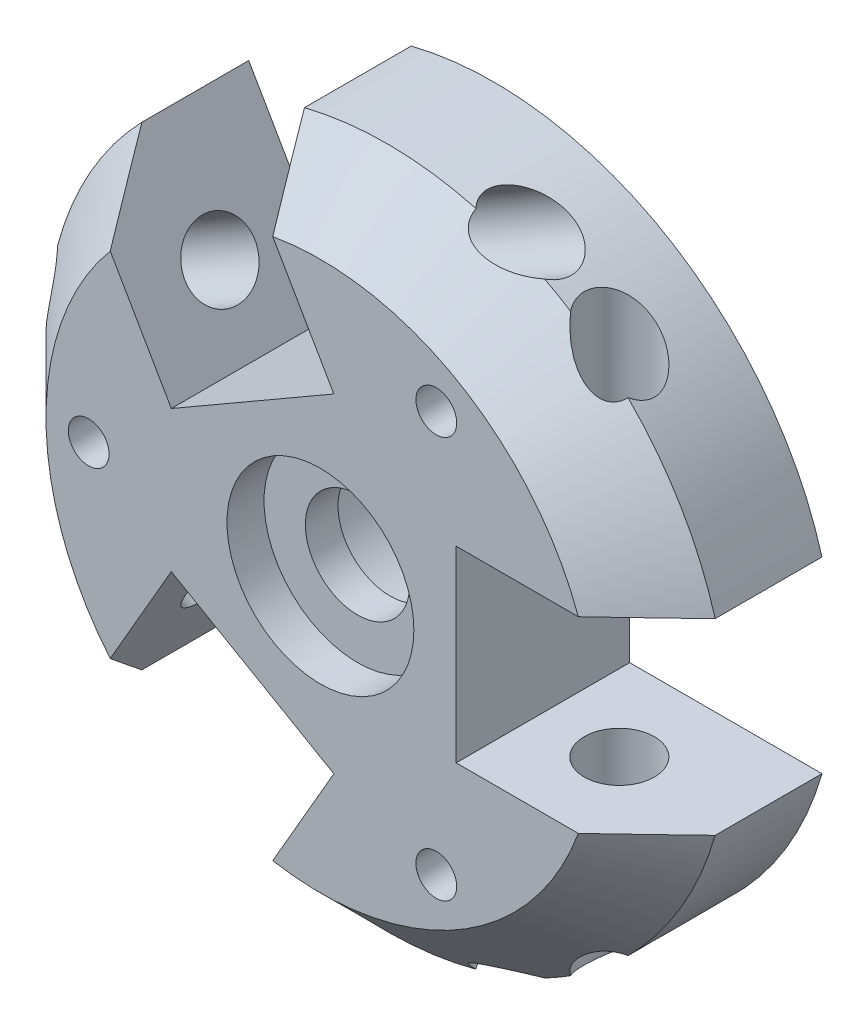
ISO-10303-21;
HEADER;
FILE_DESCRIPTION(('STEP AP214'),'2;1');
FILE_NAME('part.step','',(''),(''),'','','');
FILE_SCHEMA(('AUTOMOTIVE_DESIGN { 1 0 10303 214 1 1 1 1 }'));
ENDSEC;
DATA;
#1=APPLICATION_CONTEXT('core data for automotive mechanical design processes');
#2=APPLICATION_PROTOCOL_DEFINITION('international standard','automotive_design',2000,#1);
#3=PRODUCT_CONTEXT('',#1,'mechanical');
#4=PRODUCT('Part','Part','',(#3));
#5=PRODUCT_RELATED_PRODUCT_CATEGORY('part','',(#4));
#6=PRODUCT_DEFINITION_FORMATION('','',#4);
#7=PRODUCT_DEFINITION_CONTEXT('part definition',#1,'design');
#8=PRODUCT_DEFINITION('design','',#6,#7);
#9=PRODUCT_DEFINITION_SHAPE('','',#8);
#10=(LENGTH_UNIT() NAMED_UNIT(*) SI_UNIT(.MILLI.,.METRE.));
#11=(NAMED_UNIT(*) PLANE_ANGLE_UNIT() SI_UNIT($,.RADIAN.));
#12=(NAMED_UNIT(*) SI_UNIT($,.STERADIAN.) SOLID_ANGLE_UNIT());
#13=UNCERTAINTY_MEASURE_WITH_UNIT(LENGTH_MEASURE(1.E-05),#10,'distance_accuracy_value','');
#14=(GEOMETRIC_REPRESENTATION_CONTEXT(3) GLOBAL_UNCERTAINTY_ASSIGNED_CONTEXT((#13)) GLOBAL_UNIT_ASSIGNED_CONTEXT((#10,
#11,#12)) REPRESENTATION_CONTEXT('',''));
#15=CARTESIAN_POINT('',(0.,0.,0.));
#16=DIRECTION('',(0.,0.,1.));
#17=DIRECTION('',(1.,0.,0.));
#18=AXIS2_PLACEMENT_3D('',#15,#16,#17);
#19=CARTESIAN_POINT('',(0.,0.,-5.9436));
#20=DIRECTION('',(0.,0.,1.));
#21=DIRECTION('',(1.,0.,0.));
#22=AXIS2_PLACEMENT_3D('',#19,#20,#21);
#23=CYLINDRICAL_SURFACE('',#22,1.7859375);
#24=CARTESIAN_POINT('',(0.,0.,-1.27));
#25=DIRECTION('',(0.,0.,1.));
#26=DIRECTION('',(1.,0.,0.));
#27=AXIS2_PLACEMENT_3D('',#24,#25,#26);
#28=CIRCLE('',#27,1.7859375);
#29=CARTESIAN_POINT('',(1.7859375,0.,-1.27));
#30=VERTEX_POINT('',#29);
#31=EDGE_CURVE('E203',#30,#30,#28,.F.);
#32=ORIENTED_EDGE('',*,*,#31,.F.);
#33=EDGE_LOOP('',(#32));
#34=FACE_BOUND('',#33,.T.);
#35=CARTESIAN_POINT('',(0.,0.,-2.3876));
#36=DIRECTION('',(0.,0.,-1.));
#37=DIRECTION('',(-1.,0.,0.));
#38=AXIS2_PLACEMENT_3D('',#35,#36,#37);
#39=CIRCLE('',#38,1.7859375);
#40=CARTESIAN_POINT('',(-1.7859375,0.,-2.3876));
#41=VERTEX_POINT('',#40);
#42=EDGE_CURVE('E541',#41,#41,#39,.F.);
#43=ORIENTED_EDGE('',*,*,#42,.F.);
#44=EDGE_LOOP('',(#43));
#45=FACE_BOUND('',#44,.T.);
#46=ADVANCED_FACE('F35',(#34,#45),#23,.F.);
#47=CARTESIAN_POINT('',(0.,0.,-5.9436));
#48=DIRECTION('',(0.,0.,1.));
#49=DIRECTION('',(1.,0.,0.));
#50=AXIS2_PLACEMENT_3D('',#47,#48,#49);
#51=CYLINDRICAL_SURFACE('',#50,11.684);
#52=DIRECTION('',(0.,0.,1.));
#53=VECTOR('',#52,1.);
#54=CARTESIAN_POINT('',(11.2335143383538,-3.2131,-5.9436));
#55=LINE('',#54,#53);
#56=CARTESIAN_POINT('',(11.2335143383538,-3.2131,-2.286));
#57=VERTEX_POINT('',#56);
#58=CARTESIAN_POINT('',(11.2335143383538,-3.2131,-5.9436));
#59=VERTEX_POINT('',#58);
#60=EDGE_CURVE('E517',#57,#59,#55,.F.);
#61=ORIENTED_EDGE('',*,*,#60,.F.);
#62=CARTESIAN_POINT('',(0.,0.,-2.286));
#63=DIRECTION('',(0.,0.,1.));
#64=DIRECTION('',(1.,0.,0.));
#65=AXIS2_PLACEMENT_3D('',#62,#63,#64);
#66=CIRCLE('',#65,11.684);
#67=CARTESIAN_POINT('',(8.24930526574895,-8.27434702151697,-2.28600000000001));
#68=VERTEX_POINT('',#67);
#69=EDGE_CURVE('E886',#57,#68,#66,.F.);
#70=ORIENTED_EDGE('',*,*,#69,.T.);
#71=CARTESIAN_POINT('',(7.2644,-9.15119383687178,-1.77165));
#72=CARTESIAN_POINT('',(7.18461998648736,-9.2145226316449,-1.77164963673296));
#73=CARTESIAN_POINT('',(7.10393608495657,-9.27685746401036,-1.77959423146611));
#74=CARTESIAN_POINT('',(6.94313269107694,-9.3978120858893,-1.81254343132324));
#75=CARTESIAN_POINT('',(6.86301326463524,-9.45643144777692,-1.83754999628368));
#76=CARTESIAN_POINT('',(6.72353502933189,-9.55592101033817,-1.89834954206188));
#77=CARTESIAN_POINT('',(6.66343340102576,-9.59788821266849,-1.93064062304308));
#78=CARTESIAN_POINT('',(6.54765089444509,-9.67724280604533,-2.00670280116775));
#79=CARTESIAN_POINT('',(6.49196386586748,-9.71463660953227,-2.05045754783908));
#80=CARTESIAN_POINT('',(6.39527181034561,-9.77850738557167,-2.14190821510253));
#81=CARTESIAN_POINT('',(6.3533161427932,-9.80578070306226,-2.18803960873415));
#82=CARTESIAN_POINT('',(6.27609698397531,-9.85538274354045,-2.28798770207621));
#83=CARTESIAN_POINT('',(6.24083224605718,-9.87771238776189,-2.34180296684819));
#84=CARTESIAN_POINT('',(6.17859853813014,-9.91676065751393,-2.45637059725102));
#85=CARTESIAN_POINT('',(6.15167857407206,-9.93344618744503,-2.51716117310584));
#86=CARTESIAN_POINT('',(6.10804919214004,-9.9603342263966,-2.64365450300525));
#87=CARTESIAN_POINT('',(6.0913339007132,-9.9705404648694,-2.70935440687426));
#88=CARTESIAN_POINT('',(6.07040847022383,-9.98329247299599,-2.83608676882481));
#89=CARTESIAN_POINT('',(6.06504558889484,-9.9865447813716,-2.89686002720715));
#90=CARTESIAN_POINT('',(6.06362001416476,-9.98741062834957,-3.01854476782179));
#91=CARTESIAN_POINT('',(6.06755387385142,-9.98502625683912,-3.07945619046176));
#92=CARTESIAN_POINT('',(6.08407027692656,-9.97497011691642,-3.19653463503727));
#93=CARTESIAN_POINT('',(6.09621631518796,-9.96756515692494,-3.25278743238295));
#94=CARTESIAN_POINT('',(6.12809736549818,-9.94799607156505,-3.36221624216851));
#95=CARTESIAN_POINT('',(6.14783268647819,-9.93583175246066,-3.41539212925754));
#96=CARTESIAN_POINT('',(6.19474363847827,-9.90665383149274,-3.51910111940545));
#97=CARTESIAN_POINT('',(6.22213814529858,-9.88949685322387,-3.56949422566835));
#98=CARTESIAN_POINT('',(6.28289540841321,-9.85100870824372,-3.66476818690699));
#99=CARTESIAN_POINT('',(6.31626007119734,-9.82967620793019,-3.70964727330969));
#100=CARTESIAN_POINT('',(6.39132469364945,-9.78105377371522,-3.79748888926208));
#101=CARTESIAN_POINT('',(6.43352458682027,-9.75338137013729,-3.83981064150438));
#102=CARTESIAN_POINT('',(6.52214900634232,-9.69434203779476,-3.91671886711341));
#103=CARTESIAN_POINT('',(6.56857557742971,-9.66297331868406,-3.95130156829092));
#104=CARTESIAN_POINT('',(6.67161321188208,-9.59217924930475,-4.01739008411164));
#105=CARTESIAN_POINT('',(6.72869732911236,-9.55225492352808,-4.04762113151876));
#106=CARTESIAN_POINT('',(6.84496419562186,-9.46928909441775,-4.09805756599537));
#107=CARTESIAN_POINT('',(6.90414811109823,-9.42624584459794,-4.11825728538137));
#108=CARTESIAN_POINT('',(7.03415242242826,-9.3297500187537,-4.15190167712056));
#109=CARTESIAN_POINT('',(7.10512233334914,-9.27583291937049,-4.1634366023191));
#110=CARTESIAN_POINT('',(7.24637665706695,-9.16591051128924,-4.17390616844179));
#111=CARTESIAN_POINT('',(7.31666049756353,-9.10990362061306,-4.1728310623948));
#112=CARTESIAN_POINT('',(7.46699637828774,-8.98725470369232,-4.15753015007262));
#113=CARTESIAN_POINT('',(7.5466750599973,-8.92042494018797,-4.14109730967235));
#114=CARTESIAN_POINT('',(7.70147888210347,-8.78712218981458,-4.09247430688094));
#115=CARTESIAN_POINT('',(7.77660174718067,-8.72064939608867,-4.06027634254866));
#116=CARTESIAN_POINT('',(7.9117408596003,-8.59811104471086,-3.98498934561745));
#117=CARTESIAN_POINT('',(7.97248659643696,-8.54175671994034,-3.9436805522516));
#118=CARTESIAN_POINT('',(8.08738471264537,-8.43304689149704,-3.84850289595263));
#119=CARTESIAN_POINT('',(8.14154755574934,-8.3806850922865,-3.79465437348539));
#120=CARTESIAN_POINT('',(8.22639648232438,-8.29727126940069,-3.69151237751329));
#121=CARTESIAN_POINT('',(8.25931893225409,-8.26446217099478,-3.64548249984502));
#122=CARTESIAN_POINT('',(8.31943102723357,-8.20394618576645,-3.54677489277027));
#123=CARTESIAN_POINT('',(8.34662922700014,-8.17623169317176,-3.49410727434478));
#124=CARTESIAN_POINT('',(8.38893591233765,-8.13279421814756,-3.39383250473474));
#125=CARTESIAN_POINT('',(8.40537683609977,-8.11577973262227,-3.34735383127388));
#126=CARTESIAN_POINT('',(8.43266186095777,-8.08742602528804,-3.25111771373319));
#127=CARTESIAN_POINT('',(8.44351056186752,-8.07608213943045,-3.20136300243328));
#128=CARTESIAN_POINT('',(8.4588583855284,-8.06000623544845,-3.09946327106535));
#129=CARTESIAN_POINT('',(8.46331527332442,-8.05531819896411,-3.04730468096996));
#130=CARTESIAN_POINT('',(8.46533592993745,-8.05319484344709,-2.94270968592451));
#131=CARTESIAN_POINT('',(8.46290153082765,-8.055757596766,-2.89027335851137));
#132=CARTESIAN_POINT('',(8.45196958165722,-8.06722480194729,-2.79230596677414));
#133=CARTESIAN_POINT('',(8.44411931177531,-8.07545206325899,-2.746618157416));
#134=CARTESIAN_POINT('',(8.42358506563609,-8.09686913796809,-2.65756882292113));
#135=CARTESIAN_POINT('',(8.41089907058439,-8.11006102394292,-2.61420827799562));
#136=CARTESIAN_POINT('',(8.37607134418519,-8.14604865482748,-2.51553864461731));
#137=CARTESIAN_POINT('',(8.35217075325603,-8.17059167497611,-2.46148918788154));
#138=CARTESIAN_POINT('',(8.29829403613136,-8.2253055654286,-2.35962309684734));
#139=CARTESIAN_POINT('',(8.26830523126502,-8.25548816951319,-2.31181981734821));
#140=CARTESIAN_POINT('',(8.1914042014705,-8.33190674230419,-2.20578643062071));
#141=CARTESIAN_POINT('',(8.14236612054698,-8.37991445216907,-2.15038341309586));
#142=CARTESIAN_POINT('',(8.03767390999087,-8.48038592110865,-2.05113551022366));
#143=CARTESIAN_POINT('',(7.98201056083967,-8.53285586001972,-2.00730701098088));
#144=CARTESIAN_POINT('',(7.86396198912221,-8.64179357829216,-1.92967880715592));
#145=CARTESIAN_POINT('',(7.80142805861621,-8.69833332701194,-1.89620891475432));
#146=CARTESIAN_POINT('',(7.67239255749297,-8.8123576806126,-1.84095138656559));
#147=CARTESIAN_POINT('',(7.60589706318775,-8.86984074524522,-1.81914634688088));
#148=CARTESIAN_POINT('',(7.49341606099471,-8.96481912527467,-1.79281609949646));
#149=CARTESIAN_POINT('',(7.44824958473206,-9.00238352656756,-1.78492644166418));
#150=CARTESIAN_POINT('',(7.35695791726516,-9.07714231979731,-1.77434157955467));
#151=CARTESIAN_POINT('',(7.31083204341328,-9.11433641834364,-1.77165021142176));
#152=CARTESIAN_POINT('',(7.2644,-9.15119383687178,-1.77165));
#153=B_SPLINE_CURVE_WITH_KNOTS('',3,(#71,#72,#73,#74,#75,#76,#77,#78,#79,#80,#81,#82,#83,#84,
#85,#86,#87,#88,#89,#90,#91,#92,#93,#94,#95,#96,#97,#98,#99,#100,#101,#102,#103,#104,#105,#106,
#107,#108,#109,#110,#111,#112,#113,#114,#115,#116,#117,#118,#119,#120,#121,#122,#123,#124,#125,
#126,#127,#128,#129,#130,#131,#132,#133,#134,#135,#136,#137,#138,#139,#140,#141,#142,#143,#144,
#145,#146,#147,#148,#149,#150,#151,#152),.UNSPECIFIED.,.T.,.F.,(4,2,2,2,2,2,2,2,2,2,2,2,2,2,2,2,
2,2,2,2,2,2,2,2,2,2,2,2,2,2,2,2,2,2,2,2,2,2,2,2,4),(0.,0.305380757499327,0.610796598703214,
0.850167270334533,1.08919837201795,1.29253095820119,1.4958256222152,1.70029248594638,
1.90464155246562,2.08698628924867,2.26926342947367,2.44254293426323,2.61582949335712,
2.79468914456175,2.97360601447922,3.17042000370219,3.36732971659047,3.59428662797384,
3.82137162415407,4.0899666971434,4.35876939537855,4.67332081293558,4.9880280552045,
5.26480728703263,5.54114064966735,5.7367607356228,5.9320863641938,6.0879364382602,
6.24365811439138,6.40040407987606,6.5571083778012,6.69774497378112,6.83844034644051,
7.02935659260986,7.22067457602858,7.4838481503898,7.74739232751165,8.01862364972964,
8.28944915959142,8.46705003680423,8.64478192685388),.UNSPECIFIED.);
#154=CARTESIAN_POINT('',(6.27949473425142,-9.85311127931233,-2.2859999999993));
#155=VERTEX_POINT('',#154);
#156=EDGE_CURVE('E448',#155,#68,#153,.T.);
#157=ORIENTED_EDGE('',*,*,#156,.F.);
#158=CARTESIAN_POINT('',(0.,0.,-2.286));
#159=DIRECTION('',(0.,0.,1.));
#160=DIRECTION('',(1.,0.,0.));
#161=AXIS2_PLACEMENT_3D('',#158,#159,#160);
#162=CIRCLE('',#161,11.684);
#163=CARTESIAN_POINT('',(5.3932973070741,-10.3647576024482,-2.286));
#164=VERTEX_POINT('',#163);
#165=EDGE_CURVE('E888',#155,#164,#162,.F.);
#166=ORIENTED_EDGE('',*,*,#165,.T.);
#167=CARTESIAN_POINT('',(5.61689494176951,-10.2453085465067,-2.9718));
#168=CARTESIAN_POINT('',(5.61689745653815,-10.2453068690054,-2.91184557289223));
#169=CARTESIAN_POINT('',(5.61227003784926,-10.2478480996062,-2.85190629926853));
#170=CARTESIAN_POINT('',(5.59398178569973,-10.2578424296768,-2.73385705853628));
#171=CARTESIAN_POINT('',(5.58032236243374,-10.2652947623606,-2.67574680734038));
#172=CARTESIAN_POINT('',(5.5446133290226,-10.2846256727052,-2.56312460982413));
#173=CARTESIAN_POINT('',(5.52258396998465,-10.2964935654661,-2.50860434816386));
#174=CARTESIAN_POINT('',(5.47101187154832,-10.3239883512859,-2.40428836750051));
#175=CARTESIAN_POINT('',(5.44146758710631,-10.3396160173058,-2.35449362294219));
#176=CARTESIAN_POINT('',(5.3743788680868,-10.3746518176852,-2.25836328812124));
#177=CARTESIAN_POINT('',(5.33652701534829,-10.3942016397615,-2.21229513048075));
#178=CARTESIAN_POINT('',(5.25496490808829,-10.435674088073,-2.12694039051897));
#179=CARTESIAN_POINT('',(5.21125266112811,-10.4575975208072,-2.08765612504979));
#180=CARTESIAN_POINT('',(5.1129859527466,-10.5060273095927,-2.01134517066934));
#181=CARTESIAN_POINT('',(5.05776321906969,-10.5327545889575,-1.97532172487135));
#182=CARTESIAN_POINT('',(4.94284243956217,-10.5871722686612,-1.91230198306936));
#183=CARTESIAN_POINT('',(4.8831417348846,-10.6148632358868,-1.88531110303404));
#184=CARTESIAN_POINT('',(4.74994195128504,-10.6752108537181,-1.83616982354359));
#185=CARTESIAN_POINT('',(4.67584638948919,-10.707895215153,-1.81567257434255));
#186=CARTESIAN_POINT('',(4.52509933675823,-10.7724684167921,-1.78613469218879));
#187=CARTESIAN_POINT('',(4.44844662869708,-10.8043568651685,-1.77709959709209));
#188=CARTESIAN_POINT('',(4.27992201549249,-10.872340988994,-1.7691926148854));
#189=CARTESIAN_POINT('',(4.18782756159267,-10.9081412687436,-1.77247848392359));
#190=CARTESIAN_POINT('',(4.00410806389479,-10.9769133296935,-1.79337151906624));
#191=CARTESIAN_POINT('',(3.91248387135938,-11.0098810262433,-1.81099899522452));
#192=CARTESIAN_POINT('',(3.72020089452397,-11.0764426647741,-1.86329710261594));
#193=CARTESIAN_POINT('',(3.61989172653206,-11.1095739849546,-1.8998646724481));
#194=CARTESIAN_POINT('',(3.4260114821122,-11.1708809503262,-1.9907669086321));
#195=CARTESIAN_POINT('',(3.3324305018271,-11.1990639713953,-2.04507477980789));
#196=CARTESIAN_POINT('',(3.18800412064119,-11.2408190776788,-2.14977337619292));
#197=CARTESIAN_POINT('',(3.13372557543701,-11.256038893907,-2.19479218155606));
#198=CARTESIAN_POINT('',(3.0321979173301,-11.2838105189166,-2.29287059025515));
#199=CARTESIAN_POINT('',(2.98493631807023,-11.2963670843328,-2.34591556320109));
#200=CARTESIAN_POINT('',(2.90978418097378,-11.3159256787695,-2.44719041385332));
#201=CARTESIAN_POINT('',(2.87992631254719,-11.3235418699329,-2.49383321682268));
#202=CARTESIAN_POINT('',(2.82785339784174,-11.336658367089,-2.5915223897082));
#203=CARTESIAN_POINT('',(2.80563335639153,-11.3421600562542,-2.6425658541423));
#204=CARTESIAN_POINT('',(2.77043639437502,-11.3508095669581,-2.74855826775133));
#205=CARTESIAN_POINT('',(2.75755129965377,-11.3539340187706,-2.80354032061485));
#206=CARTESIAN_POINT('',(2.74277207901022,-11.357513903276,-2.91503831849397));
#207=CARTESIAN_POINT('',(2.74086669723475,-11.3579720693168,-2.97155263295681));
#208=CARTESIAN_POINT('',(2.74767320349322,-11.3563264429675,-3.07536192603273));
#209=CARTESIAN_POINT('',(2.75484112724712,-11.3545952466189,-3.12277264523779));
#210=CARTESIAN_POINT('',(2.77664465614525,-11.3492830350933,-3.21572735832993));
#211=CARTESIAN_POINT('',(2.79128349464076,-11.3457012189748,-3.26127053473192));
#212=CARTESIAN_POINT('',(2.83149568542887,-11.3357404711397,-3.36055909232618));
#213=CARTESIAN_POINT('',(2.85888546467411,-11.3288867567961,-3.41351769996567));
#214=CARTESIAN_POINT('',(2.92157844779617,-11.3128813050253,-3.51412636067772));
#215=CARTESIAN_POINT('',(2.95689505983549,-11.3037256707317,-3.56176721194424));
#216=CARTESIAN_POINT('',(3.04747224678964,-11.2797017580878,-3.6678102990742));
#217=CARTESIAN_POINT('',(3.10531045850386,-11.263967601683,-3.72380646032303));
#218=CARTESIAN_POINT('',(3.22847030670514,-11.2292901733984,-3.8256059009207));
#219=CARTESIAN_POINT('',(3.29380488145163,-11.2103413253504,-3.8713911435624));
#220=CARTESIAN_POINT('',(3.45040846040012,-11.1632920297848,-3.96576437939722));
#221=CARTESIAN_POINT('',(3.54346854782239,-11.1341702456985,-4.01087433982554));
#222=CARTESIAN_POINT('',(3.73443544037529,-11.071584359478,-4.08481312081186));
#223=CARTESIAN_POINT('',(3.83234570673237,-11.0381171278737,-4.11363012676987));
#224=CARTESIAN_POINT('',(4.03125950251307,-10.9670444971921,-4.15498950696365));
#225=CARTESIAN_POINT('',(4.13228432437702,-10.9294005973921,-4.1673639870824));
#226=CARTESIAN_POINT('',(4.33376626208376,-10.8510817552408,-4.17442586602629));
#227=CARTESIAN_POINT('',(4.4342237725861,-10.8104093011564,-4.16912763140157));
#228=CARTESIAN_POINT('',(4.61560392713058,-10.7340640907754,-4.14198064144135));
#229=CARTESIAN_POINT('',(4.69705583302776,-10.698648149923,-4.12295068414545));
#230=CARTESIAN_POINT('',(4.85528509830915,-10.6277722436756,-4.07075250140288));
#231=CARTESIAN_POINT('',(4.93206796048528,-10.5923123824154,-4.03760130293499));
#232=CARTESIAN_POINT('',(5.06560300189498,-10.5290082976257,-3.96362813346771));
#233=CARTESIAN_POINT('',(5.12352012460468,-10.5009095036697,-3.92513218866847));
#234=CARTESIAN_POINT('',(5.2325372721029,-10.4470140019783,-3.8380774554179));
#235=CARTESIAN_POINT('',(5.2836387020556,-10.4212168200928,-3.7895207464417));
#236=CARTESIAN_POINT('',(5.377332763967,-10.373184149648,-3.68246291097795));
#237=CARTESIAN_POINT('',(5.41985721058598,-10.3509774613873,-3.62388844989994));
#238=CARTESIAN_POINT('',(5.49371070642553,-10.3119714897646,-3.49843462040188));
#239=CARTESIAN_POINT('',(5.5250489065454,-10.2951677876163,-3.43156210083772));
#240=CARTESIAN_POINT('',(5.57180295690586,-10.2699315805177,-3.29990659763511));
#241=CARTESIAN_POINT('',(5.58863584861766,-10.2607584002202,-3.23576834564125));
#242=CARTESIAN_POINT('',(5.61117665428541,-10.2484498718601,-3.10501268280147));
#243=CARTESIAN_POINT('',(5.61689214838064,-10.2453104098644,-3.03839699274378));
#244=CARTESIAN_POINT('',(5.61689494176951,-10.2453085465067,-2.9718));
#245=B_SPLINE_CURVE_WITH_KNOTS('',3,(#167,#168,#169,#170,#171,#172,#173,#174,#175,#176,#177,
#178,#179,#180,#181,#182,#183,#184,#185,#186,#187,#188,#189,#190,#191,#192,#193,#194,#195,#196,
#197,#198,#199,#200,#201,#202,#203,#204,#205,#206,#207,#208,#209,#210,#211,#212,#213,#214,#215,
#216,#217,#218,#219,#220,#221,#222,#223,#224,#225,#226,#227,#228,#229,#230,#231,#232,#233,#234,
#235,#236,#237,#238,#239,#240,#241,#242,#243,#244),.UNSPECIFIED.,.T.,.F.,(4,2,2,2,2,2,2,2,2,2,2,
2,2,2,2,2,2,2,2,2,2,2,2,2,2,2,2,2,2,2,2,2,2,2,2,2,2,2,4),(0.,0.17961021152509,0.359192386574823,
0.538342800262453,0.717530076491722,0.905025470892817,1.09258477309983,1.30520857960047,
1.51795964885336,1.76763561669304,2.01743216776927,2.31285454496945,2.60869601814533,
2.94250495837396,3.27581202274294,3.49158353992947,3.70696637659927,3.87405720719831,
4.04103855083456,4.20964094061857,4.37807045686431,4.52133202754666,4.66465565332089,
4.84372025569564,5.02309005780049,5.26783284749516,5.51300458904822,5.83366903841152,
6.15456571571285,6.47871450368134,6.80259984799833,7.07404117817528,7.34515613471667,
7.56927194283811,7.79334147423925,8.01912760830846,8.24472861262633,8.44437465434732,
8.64388452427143),.UNSPECIFIED.);
#246=CARTESIAN_POINT('',(3.04114208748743,-11.2812814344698,-2.28600000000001));
#247=VERTEX_POINT('',#246);
#248=EDGE_CURVE('E236',#247,#164,#245,.T.);
#249=ORIENTED_EDGE('',*,*,#248,.F.);
#250=CARTESIAN_POINT('',(0.,0.,-2.286));
#251=DIRECTION('',(0.,0.,1.));
#252=DIRECTION('',(1.,0.,0.));
#253=AXIS2_PLACEMENT_3D('',#250,#251,#252);
#254=CIRCLE('',#253,11.684);
#255=CARTESIAN_POINT('',(-2.83413094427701,-11.3350587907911,-2.28600000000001));
#256=VERTEX_POINT('',#255);
#257=EDGE_CURVE('E296',#247,#256,#254,.F.);
#258=ORIENTED_EDGE('',*,*,#257,.T.);
#259=DIRECTION('',(0.,0.,1.));
#260=VECTOR('',#259,1.);
#261=CARTESIAN_POINT('',(-2.83413094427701,-11.3350587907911,-5.9436));
#262=LINE('',#261,#260);
#263=CARTESIAN_POINT('',(-2.83413094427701,-11.3350587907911,-5.9436));
#264=VERTEX_POINT('',#263);
#265=EDGE_CURVE('E474',#264,#256,#262,.T.);
#266=ORIENTED_EDGE('',*,*,#265,.F.);
#267=CARTESIAN_POINT('',(0.,0.,-5.9436));
#268=DIRECTION('',(0.,0.,1.));
#269=DIRECTION('',(1.,0.,0.));
#270=AXIS2_PLACEMENT_3D('',#267,#268,#269);
#271=CIRCLE('',#270,11.684);
#272=EDGE_CURVE('E524',#264,#59,#271,.T.);
#273=ORIENTED_EDGE('',*,*,#272,.T.);
#274=EDGE_LOOP('',(#61,#70,#157,#166,#249,#258,#266,#273));
#275=FACE_BOUND('',#274,.T.);
#276=ADVANCED_FACE('F325',(#275),#51,.T.);
#277=DIRECTION('',(0.,0.,1.));
#278=VECTOR('',#277,1.);
#279=CARTESIAN_POINT('',(-8.3993833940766,-8.1219587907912,-5.9436));
#280=LINE('',#279,#278);
#281=CARTESIAN_POINT('',(-8.3993833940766,-8.1219587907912,-2.286));
#282=VERTEX_POINT('',#281);
#283=CARTESIAN_POINT('',(-8.3993833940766,-8.1219587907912,-5.9436));
#284=VERTEX_POINT('',#283);
#285=EDGE_CURVE('E470',#282,#284,#280,.F.);
#286=ORIENTED_EDGE('',*,*,#285,.F.);
#287=CARTESIAN_POINT('',(0.,0.,-2.286));
#288=DIRECTION('',(0.,0.,1.));
#289=DIRECTION('',(1.,0.,0.));
#290=AXIS2_PLACEMENT_3D('',#287,#288,#289);
#291=CIRCLE('',#290,11.684);
#292=CARTESIAN_POINT('',(-11.2904473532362,-3.00693441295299,-2.28599999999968));
#293=VERTEX_POINT('',#292);
#294=EDGE_CURVE('E862',#282,#293,#291,.F.);
#295=ORIENTED_EDGE('',*,*,#294,.T.);
#296=CARTESIAN_POINT('',(-11.6811449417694,-0.258280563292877,-2.9718));
#297=CARTESIAN_POINT('',(-11.681144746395,-0.258277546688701,-3.03175442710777));
#298=CARTESIAN_POINT('',(-11.6810318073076,-0.26355562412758,-3.09169370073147));
#299=CARTESIAN_POINT('',(-11.6805430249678,-0.284390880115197,-3.20974294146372));
#300=CARTESIAN_POINT('',(-11.6801672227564,-0.299946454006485,-3.26785319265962));
#301=CARTESIAN_POINT('',(-11.6790537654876,-0.340536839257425,-3.38047539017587));
#302=CARTESIAN_POINT('',(-11.678316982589,-0.365548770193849,-3.43499565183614));
#303=CARTESIAN_POINT('',(-11.6763421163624,-0.423958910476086,-3.5393116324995));
#304=CARTESIAN_POINT('',(-11.6751039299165,-0.457358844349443,-3.58910637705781));
#305=CARTESIAN_POINT('',(-11.6719014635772,-0.532977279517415,-3.68523671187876));
#306=CARTESIAN_POINT('',(-11.6699061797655,-0.575532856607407,-3.73130486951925));
#307=CARTESIAN_POINT('',(-11.6650413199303,-0.666903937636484,-3.81665960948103));
#308=CARTESIAN_POINT('',(-11.6621714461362,-0.715721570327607,-3.85594387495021));
#309=CARTESIAN_POINT('',(-11.6549795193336,-0.825037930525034,-3.93225482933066));
#310=CARTESIAN_POINT('',(-11.6505146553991,-0.88622586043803,-3.96827827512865));
#311=CARTESIAN_POINT('',(-11.6401813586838,-1.01295901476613,-4.03129801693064));
#312=CARTESIAN_POINT('',(-11.6343120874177,-1.07850682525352,-4.05828889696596));
#313=CARTESIAN_POINT('',(-11.6199747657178,-1.22403503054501,-4.10743017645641));
#314=CARTESIAN_POINT('',(-11.6112324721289,-1.30454585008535,-4.12792742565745));
#315=CARTESIAN_POINT('',(-11.5917809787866,-1.46738322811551,-4.15746530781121));
#316=CARTESIAN_POINT('',(-11.5810708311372,-1.54971064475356,-4.16650040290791));
#317=CARTESIAN_POINT('',(-11.5556845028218,-1.72964930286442,-4.1744073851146));
#318=CARTESIAN_POINT('',(-11.5406412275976,-1.82730557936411,-4.17112151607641));
#319=CARTESIAN_POINT('',(-11.508339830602,-2.02079736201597,-4.15022848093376));
#320=CARTESIAN_POINT('',(-11.4910785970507,-2.11663008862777,-4.13260100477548));
#321=CARTESIAN_POINT('',(-11.4525811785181,-2.3164328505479,-4.08030289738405));
#322=CARTESIAN_POINT('',(-11.4311191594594,-2.41986879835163,-4.04373532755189));
#323=CARTESIAN_POINT('',(-11.3872724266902,-2.61842749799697,-3.9528330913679));
#324=CARTESIAN_POINT('',(-11.3648891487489,-2.71356251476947,-3.89852522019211));
#325=CARTESIAN_POINT('',(-11.3288369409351,-2.85951698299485,-3.79382662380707));
#326=CARTESIAN_POINT('',(-11.3148784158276,-2.91413349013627,-3.74880781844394));
#327=CARTESIAN_POINT('',(-11.2881655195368,-3.01594483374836,-3.65072940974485));
#328=CARTESIAN_POINT('',(-11.2754090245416,-3.06315286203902,-3.59768443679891));
#329=CARTESIAN_POINT('',(-11.2547711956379,-3.13801581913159,-3.49640958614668));
#330=CARTESIAN_POINT('',(-11.2464380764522,-3.16768158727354,-3.44976678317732));
#331=CARTESIAN_POINT('',(-11.2317608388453,-3.2193363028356,-3.3520776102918));
#332=CARTESIAN_POINT('',(-11.225415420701,-3.24133026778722,-3.3010341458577));
#333=CARTESIAN_POINT('',(-11.2153076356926,-3.27613648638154,-3.19504173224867));
#334=CARTESIAN_POINT('',(-11.2115709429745,-3.28885753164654,-3.14005967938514));
#335=CARTESIAN_POINT('',(-11.207281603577,-3.30344665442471,-3.02856168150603));
#336=CARTESIAN_POINT('',(-11.2067256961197,-3.30532584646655,-2.97204736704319));
#337=CARTESIAN_POINT('',(-11.2087037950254,-3.29860842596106,-2.86823807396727));
#338=CARTESIAN_POINT('',(-11.2107884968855,-3.29153522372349,-2.82082735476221));
#339=CARTESIAN_POINT('',(-11.2170897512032,-3.26999670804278,-2.72787264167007));
#340=CARTESIAN_POINT('',(-11.2213072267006,-3.25552819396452,-2.68232946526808));
#341=CARTESIAN_POINT('',(-11.2327870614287,-3.21572304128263,-2.58304090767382));
#342=CARTESIAN_POINT('',(-11.2405464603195,-3.1885759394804,-2.53008230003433));
#343=CARTESIAN_POINT('',(-11.258031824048,-3.12627949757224,-2.42947363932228));
#344=CARTESIAN_POINT('',(-11.2677611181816,-3.0911165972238,-2.38183278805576));
#345=CARTESIAN_POINT('',(-11.2922443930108,-3.00066249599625,-2.2757897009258));
#346=CARTESIAN_POINT('',(-11.3075373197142,-2.94270605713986,-2.21979353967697));
#347=CARTESIAN_POINT('',(-11.3390857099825,-2.81870778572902,-2.1179940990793));
#348=CARTESIAN_POINT('',(-11.3553428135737,-2.75265196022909,-2.0722088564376));
#349=CARTESIAN_POINT('',(-11.392898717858,-2.59350463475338,-1.97783562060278));
#350=CARTESIAN_POINT('',(-11.4142085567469,-2.49835134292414,-1.93272566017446));
#351=CARTESIAN_POINT('',(-11.455491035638,-2.3016762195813,-1.85878687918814));
#352=CARTESIAN_POINT('',(-11.4754626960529,-2.20014982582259,-1.82996987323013));
#353=CARTESIAN_POINT('',(-11.5133688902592,-1.99234911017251,-1.78861049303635));
#354=CARTESIAN_POINT('',(-11.5312807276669,-1.88603709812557,-1.7762360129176));
#355=CARTESIAN_POINT('',(-11.5641955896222,-1.67238920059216,-1.76917413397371));
#356=CARTESIAN_POINT('',(-11.5792009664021,-1.56505421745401,-1.77447236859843));
#357=CARTESIAN_POINT('',(-11.6037741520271,-1.36980179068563,-1.80161935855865));
#358=CARTESIAN_POINT('',(-11.6138290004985,-1.28155440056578,-1.82064931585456));
#359=CARTESIAN_POINT('',(-11.6315632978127,-1.10908588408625,-1.87284749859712));
#360=CARTESIAN_POINT('',(-11.6392455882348,-1.02486004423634,-1.90599869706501));
#361=CARTESIAN_POINT('',(-11.6511901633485,-0.877563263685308,-1.97997186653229));
#362=CARTESIAN_POINT('',(-11.6558144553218,-0.813356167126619,-2.01846781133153));
#363=CARTESIAN_POINT('',(-11.6636481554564,-0.691996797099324,-2.1055225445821));
#364=CARTESIAN_POINT('',(-11.6668578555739,-0.634843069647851,-2.15407925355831));
#365=CARTESIAN_POINT('',(-11.6721073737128,-0.529685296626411,-2.26113708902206));
#366=CARTESIAN_POINT('',(-11.6741380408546,-0.481754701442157,-2.31971155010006));
#367=CARTESIAN_POINT('',(-11.6772846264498,-0.39829271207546,-2.44516537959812));
#368=CARTESIAN_POINT('',(-11.6784012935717,-0.362751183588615,-2.51203789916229));
#369=CARTESIAN_POINT('',(-11.6799231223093,-0.309642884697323,-2.64369340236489));
#370=CARTESIAN_POINT('',(-11.6803953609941,-0.290478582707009,-2.70783165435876));
#371=CARTESIAN_POINT('',(-11.681006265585,-0.26480340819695,-2.83858731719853));
#372=CARTESIAN_POINT('',(-11.6811451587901,-0.25828391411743,-2.90520300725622));
#373=CARTESIAN_POINT('',(-11.6811449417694,-0.258280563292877,-2.9718));
#374=B_SPLINE_CURVE_WITH_KNOTS('',3,(#296,#297,#298,#299,#300,#301,#302,#303,#304,#305,#306,
#307,#308,#309,#310,#311,#312,#313,#314,#315,#316,#317,#318,#319,#320,#321,#322,#323,#324,#325,
#326,#327,#328,#329,#330,#331,#332,#333,#334,#335,#336,#337,#338,#339,#340,#341,#342,#343,#344,
#345,#346,#347,#348,#349,#350,#351,#352,#353,#354,#355,#356,#357,#358,#359,#360,#361,#362,#363,
#364,#365,#366,#367,#368,#369,#370,#371,#372,#373),.UNSPECIFIED.,.T.,.F.,(4,2,2,2,2,2,2,2,2,2,2,
2,2,2,2,2,2,2,2,2,2,2,2,2,2,2,2,2,2,2,2,2,2,2,2,2,2,2,4),(0.,0.179610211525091,
0.359192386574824,0.538342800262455,0.717530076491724,0.90502547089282,1.09258477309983,
1.30520857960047,1.51795964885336,1.76763561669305,2.01743216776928,2.31285454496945,
2.60869601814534,2.94250495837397,3.27581202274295,3.49158353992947,3.70696637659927,
3.87405720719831,4.04103855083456,4.20964094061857,4.37807045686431,4.52133202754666,
4.66465565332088,4.84372025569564,5.02309005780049,5.26783284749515,5.51300458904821,
5.83366903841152,6.15456571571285,6.47871450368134,6.80259984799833,7.07404117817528,
7.34515613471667,7.56927194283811,7.79334147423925,8.01912760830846,8.24472861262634,
8.44437465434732,8.64388452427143),.UNSPECIFIED.);
#375=CARTESIAN_POINT('',(-11.6727920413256,-0.511646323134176,-2.28599999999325));
#376=VERTEX_POINT('',#375);
#377=EDGE_CURVE('E230',#376,#293,#374,.T.);
#378=ORIENTED_EDGE('',*,*,#377,.F.);
#379=CARTESIAN_POINT('',(0.,0.,-2.286));
#380=DIRECTION('',(0.,0.,1.));
#381=DIRECTION('',(1.,0.,0.));
#382=AXIS2_PLACEMENT_3D('',#379,#380,#381);
#383=CIRCLE('',#382,11.684);
#384=CARTESIAN_POINT('',(-11.6727920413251,0.511646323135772,-2.286));
#385=VERTEX_POINT('',#384);
#386=EDGE_CURVE('E861',#376,#385,#383,.F.);
#387=ORIENTED_EDGE('',*,*,#386,.T.);
#388=CARTESIAN_POINT('',(-11.6811449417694,0.258280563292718,-2.9718));
#389=CARTESIAN_POINT('',(-11.681144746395,0.258277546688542,-2.91184557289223));
#390=CARTESIAN_POINT('',(-11.6810318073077,0.26355562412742,-2.85190629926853));
#391=CARTESIAN_POINT('',(-11.6805430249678,0.284390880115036,-2.73385705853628));
#392=CARTESIAN_POINT('',(-11.6801672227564,0.299946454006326,-2.67574680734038));
#393=CARTESIAN_POINT('',(-11.6790537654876,0.340536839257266,-2.56312460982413));
#394=CARTESIAN_POINT('',(-11.678316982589,0.365548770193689,-2.50860434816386));
#395=CARTESIAN_POINT('',(-11.6763421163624,0.423958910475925,-2.4042883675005));
#396=CARTESIAN_POINT('',(-11.6751039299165,0.457358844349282,-2.35449362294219));
#397=CARTESIAN_POINT('',(-11.6719014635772,0.532977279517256,-2.25836328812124));
#398=CARTESIAN_POINT('',(-11.6699061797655,0.575532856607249,-2.21229513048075));
#399=CARTESIAN_POINT('',(-11.6650413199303,0.666903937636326,-2.12694039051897));
#400=CARTESIAN_POINT('',(-11.6621714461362,0.715721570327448,-2.08765612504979));
#401=CARTESIAN_POINT('',(-11.6549795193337,0.825037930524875,-2.01134517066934));
#402=CARTESIAN_POINT('',(-11.6505146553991,0.886225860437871,-1.97532172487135));
#403=CARTESIAN_POINT('',(-11.6401813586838,1.01295901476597,-1.91230198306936));
#404=CARTESIAN_POINT('',(-11.6343120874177,1.07850682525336,-1.88531110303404));
#405=CARTESIAN_POINT('',(-11.6199747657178,1.22403503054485,-1.83616982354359));
#406=CARTESIAN_POINT('',(-11.611232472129,1.30454585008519,-1.81567257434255));
#407=CARTESIAN_POINT('',(-11.5917809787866,1.46738322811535,-1.78613469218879));
#408=CARTESIAN_POINT('',(-11.5810708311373,1.5497106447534,-1.77709959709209));
#409=CARTESIAN_POINT('',(-11.5556845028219,1.72964930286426,-1.7691926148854));
#410=CARTESIAN_POINT('',(-11.5406412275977,1.82730557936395,-1.77247848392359));
#411=CARTESIAN_POINT('',(-11.508339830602,2.02079736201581,-1.79337151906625));
#412=CARTESIAN_POINT('',(-11.4910785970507,2.11663008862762,-1.81099899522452));
#413=CARTESIAN_POINT('',(-11.4525811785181,2.31643285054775,-1.86329710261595));
#414=CARTESIAN_POINT('',(-11.4311191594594,2.41986879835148,-1.89986467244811));
#415=CARTESIAN_POINT('',(-11.3872724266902,2.61842749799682,-1.99076690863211));
#416=CARTESIAN_POINT('',(-11.3648891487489,2.71356251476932,-2.04507477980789));
#417=CARTESIAN_POINT('',(-11.3288369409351,2.8595169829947,-2.14977337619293));
#418=CARTESIAN_POINT('',(-11.3148784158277,2.91413349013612,-2.19479218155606));
#419=CARTESIAN_POINT('',(-11.2881655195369,3.01594483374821,-2.29287059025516));
#420=CARTESIAN_POINT('',(-11.2754090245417,3.06315286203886,-2.3459155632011));
#421=CARTESIAN_POINT('',(-11.254771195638,3.13801581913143,-2.44719041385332));
#422=CARTESIAN_POINT('',(-11.2464380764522,3.16768158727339,-2.49383321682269));
#423=CARTESIAN_POINT('',(-11.2317608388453,3.21933630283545,-2.5915223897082));
#424=CARTESIAN_POINT('',(-11.225415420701,3.24133026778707,-2.64256585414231));
#425=CARTESIAN_POINT('',(-11.2153076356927,3.27613648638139,-2.74855826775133));
#426=CARTESIAN_POINT('',(-11.2115709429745,3.28885753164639,-2.80354032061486));
#427=CARTESIAN_POINT('',(-11.2072816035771,3.30344665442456,-2.91503831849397));
#428=CARTESIAN_POINT('',(-11.2067256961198,3.3053258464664,-2.97155263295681));
#429=CARTESIAN_POINT('',(-11.2087037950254,3.2986084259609,-3.07536192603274));
#430=CARTESIAN_POINT('',(-11.2107884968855,3.29153522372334,-3.12277264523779));
#431=CARTESIAN_POINT('',(-11.2170897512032,3.26999670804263,-3.21572735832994));
#432=CARTESIAN_POINT('',(-11.2213072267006,3.25552819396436,-3.26127053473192));
#433=CARTESIAN_POINT('',(-11.2327870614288,3.21572304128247,-3.36055909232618));
#434=CARTESIAN_POINT('',(-11.2405464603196,3.18857593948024,-3.41351769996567));
#435=CARTESIAN_POINT('',(-11.258031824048,3.12627949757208,-3.51412636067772));
#436=CARTESIAN_POINT('',(-11.2677611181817,3.09111659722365,-3.56176721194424));
#437=CARTESIAN_POINT('',(-11.2922443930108,3.0006624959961,-3.6678102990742));
#438=CARTESIAN_POINT('',(-11.3075373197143,2.9427060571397,-3.72380646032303));
#439=CARTESIAN_POINT('',(-11.3390857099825,2.81870778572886,-3.8256059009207));
#440=CARTESIAN_POINT('',(-11.3553428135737,2.75265196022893,-3.8713911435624));
#441=CARTESIAN_POINT('',(-11.3928987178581,2.59350463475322,-3.96576437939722));
#442=CARTESIAN_POINT('',(-11.4142085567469,2.49835134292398,-4.01087433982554));
#443=CARTESIAN_POINT('',(-11.4554910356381,2.30167621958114,-4.08481312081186));
#444=CARTESIAN_POINT('',(-11.4754626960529,2.20014982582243,-4.11363012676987));
#445=CARTESIAN_POINT('',(-11.5133688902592,1.99234911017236,-4.15498950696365));
#446=CARTESIAN_POINT('',(-11.5312807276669,1.88603709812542,-4.1673639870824));
#447=CARTESIAN_POINT('',(-11.5641955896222,1.67238920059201,-4.17442586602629));
#448=CARTESIAN_POINT('',(-11.5792009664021,1.56505421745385,-4.16912763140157));
#449=CARTESIAN_POINT('',(-11.6037741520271,1.36980179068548,-4.14198064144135));
#450=CARTESIAN_POINT('',(-11.6138290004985,1.28155440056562,-4.12295068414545));
#451=CARTESIAN_POINT('',(-11.6315632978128,1.10908588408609,-4.07075250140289));
#452=CARTESIAN_POINT('',(-11.6392455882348,1.02486004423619,-4.03760130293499));
#453=CARTESIAN_POINT('',(-11.6511901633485,0.877563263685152,-3.96362813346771));
#454=CARTESIAN_POINT('',(-11.6558144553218,0.813356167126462,-3.92513218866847));
#455=CARTESIAN_POINT('',(-11.6636481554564,0.691996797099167,-3.8380774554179));
#456=CARTESIAN_POINT('',(-11.6668578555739,0.634843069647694,-3.7895207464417));
#457=CARTESIAN_POINT('',(-11.6721073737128,0.529685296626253,-3.68246291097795));
#458=CARTESIAN_POINT('',(-11.6741380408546,0.481754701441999,-3.62388844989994));
#459=CARTESIAN_POINT('',(-11.6772846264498,0.398292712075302,-3.49843462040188));
#460=CARTESIAN_POINT('',(-11.6784012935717,0.362751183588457,-3.43156210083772));
#461=CARTESIAN_POINT('',(-11.6799231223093,0.309642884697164,-3.29990659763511));
#462=CARTESIAN_POINT('',(-11.6803953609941,0.290478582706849,-3.23576834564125));
#463=CARTESIAN_POINT('',(-11.681006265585,0.26480340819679,-3.10501268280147));
#464=CARTESIAN_POINT('',(-11.6811451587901,0.258283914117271,-3.03839699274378));
#465=CARTESIAN_POINT('',(-11.6811449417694,0.258280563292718,-2.9718));
#466=B_SPLINE_CURVE_WITH_KNOTS('',3,(#388,#389,#390,#391,#392,#393,#394,#395,#396,#397,#398,
#399,#400,#401,#402,#403,#404,#405,#406,#407,#408,#409,#410,#411,#412,#413,#414,#415,#416,#417,
#418,#419,#420,#421,#422,#423,#424,#425,#426,#427,#428,#429,#430,#431,#432,#433,#434,#435,#436,
#437,#438,#439,#440,#441,#442,#443,#444,#445,#446,#447,#448,#449,#450,#451,#452,#453,#454,#455,
#456,#457,#458,#459,#460,#461,#462,#463,#464,#465),.UNSPECIFIED.,.T.,.F.,(4,2,2,2,2,2,2,2,2,2,2,
2,2,2,2,2,2,2,2,2,2,2,2,2,2,2,2,2,2,2,2,2,2,2,2,2,2,2,4),(0.,0.17961021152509,0.359192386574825,
0.538342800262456,0.717530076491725,0.905025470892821,1.09258477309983,1.30520857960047,
1.51795964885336,1.76763561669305,2.01743216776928,2.31285454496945,2.60869601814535,
2.94250495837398,3.27581202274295,3.49158353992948,3.70696637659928,3.87405720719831,
4.04103855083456,4.20964094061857,4.37807045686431,4.52133202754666,4.66465565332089,
4.84372025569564,5.02309005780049,5.26783284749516,5.51300458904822,5.83366903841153,
6.15456571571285,6.47871450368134,6.80259984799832,7.07404117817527,7.34515613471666,
7.56927194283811,7.79334147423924,8.01912760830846,8.24472861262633,8.44437465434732,
8.64388452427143),.UNSPECIFIED.);
#467=CARTESIAN_POINT('',(-11.2904473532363,3.0069344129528,-2.28600000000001));
#468=VERTEX_POINT('',#467);
#469=EDGE_CURVE('E535',#468,#385,#466,.T.);
#470=ORIENTED_EDGE('',*,*,#469,.F.);
#471=CARTESIAN_POINT('',(0.,0.,-2.286));
#472=DIRECTION('',(0.,0.,1.));
#473=DIRECTION('',(1.,0.,0.));
#474=AXIS2_PLACEMENT_3D('',#471,#472,#473);
#475=CIRCLE('',#474,11.684);
#476=CARTESIAN_POINT('',(-8.39938339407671,8.12195879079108,-2.28600000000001));
#477=VERTEX_POINT('',#476);
#478=EDGE_CURVE('E55',#468,#477,#475,.F.);
#479=ORIENTED_EDGE('',*,*,#478,.T.);
#480=DIRECTION('',(0.,0.,1.));
#481=VECTOR('',#480,1.);
#482=CARTESIAN_POINT('',(-8.39938339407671,8.12195879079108,-5.9436));
#483=LINE('',#482,#481);
#484=CARTESIAN_POINT('',(-8.39938339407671,8.12195879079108,-5.9436));
#485=VERTEX_POINT('',#484);
#486=EDGE_CURVE('E497',#485,#477,#483,.T.);
#487=ORIENTED_EDGE('',*,*,#486,.F.);
#488=EDGE_CURVE('E528',#485,#284,#271,.T.);
#489=ORIENTED_EDGE('',*,*,#488,.T.);
#490=EDGE_LOOP('',(#286,#295,#378,#387,#470,#479,#487,#489));
#491=FACE_BOUND('',#490,.T.);
#492=ADVANCED_FACE('F331',(#491),#51,.T.);
#493=DIRECTION('',(0.,0.,1.));
#494=VECTOR('',#493,1.);
#495=CARTESIAN_POINT('',(-2.83413094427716,11.3350587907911,-5.9436));
#496=LINE('',#495,#494);
#497=CARTESIAN_POINT('',(-2.83413094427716,11.3350587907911,-2.286));
#498=VERTEX_POINT('',#497);
#499=CARTESIAN_POINT('',(-2.83413094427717,11.3350587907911,-5.9436));
#500=VERTEX_POINT('',#499);
#501=EDGE_CURVE('E493',#498,#500,#496,.F.);
#502=ORIENTED_EDGE('',*,*,#501,.F.);
#503=CARTESIAN_POINT('',(0.,0.,-2.286));
#504=DIRECTION('',(0.,0.,1.));
#505=DIRECTION('',(1.,0.,0.));
#506=AXIS2_PLACEMENT_3D('',#503,#504,#505);
#507=CIRCLE('',#506,11.684);
#508=CARTESIAN_POINT('',(3.04114208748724,11.2812814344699,-2.28599999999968));
#509=VERTEX_POINT('',#508);
#510=EDGE_CURVE('E420',#498,#509,#507,.F.);
#511=ORIENTED_EDGE('',*,*,#510,.T.);
#512=CARTESIAN_POINT('',(5.61689494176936,10.2453085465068,-2.9718));
#513=CARTESIAN_POINT('',(5.61689745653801,10.2453068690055,-3.03175442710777));
#514=CARTESIAN_POINT('',(5.61227003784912,10.2478480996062,-3.09169370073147));
#515=CARTESIAN_POINT('',(5.59398178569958,10.2578424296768,-3.20974294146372));
#516=CARTESIAN_POINT('',(5.58032236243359,10.2652947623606,-3.26785319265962));
#517=CARTESIAN_POINT('',(5.54461332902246,10.2846256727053,-3.38047539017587));
#518=CARTESIAN_POINT('',(5.52258396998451,10.2964935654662,-3.43499565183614));
#519=CARTESIAN_POINT('',(5.47101187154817,10.323988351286,-3.5393116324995));
#520=CARTESIAN_POINT('',(5.44146758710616,10.3396160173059,-3.58910637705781));
#521=CARTESIAN_POINT('',(5.37437886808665,10.3746518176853,-3.68523671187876));
#522=CARTESIAN_POINT('',(5.33652701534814,10.3942016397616,-3.73130486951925));
#523=CARTESIAN_POINT('',(5.25496490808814,10.435674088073,-3.81665960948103));
#524=CARTESIAN_POINT('',(5.21125266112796,10.4575975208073,-3.85594387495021));
#525=CARTESIAN_POINT('',(5.11298595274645,10.5060273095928,-3.93225482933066));
#526=CARTESIAN_POINT('',(5.05776321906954,10.5327545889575,-3.96827827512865));
#527=CARTESIAN_POINT('',(4.94284243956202,10.5871722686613,-4.03129801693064));
#528=CARTESIAN_POINT('',(4.88314173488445,10.6148632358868,-4.05828889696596));
#529=CARTESIAN_POINT('',(4.74994195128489,10.6752108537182,-4.10743017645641));
#530=CARTESIAN_POINT('',(4.67584638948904,10.7078952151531,-4.12792742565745));
#531=CARTESIAN_POINT('',(4.52509933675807,10.7724684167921,-4.15746530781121));
#532=CARTESIAN_POINT('',(4.44844662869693,10.8043568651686,-4.16650040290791));
#533=CARTESIAN_POINT('',(4.27992201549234,10.8723409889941,-4.1744073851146));
#534=CARTESIAN_POINT('',(4.18782756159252,10.9081412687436,-4.17112151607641));
#535=CARTESIAN_POINT('',(4.00410806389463,10.9769133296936,-4.15022848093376));
#536=CARTESIAN_POINT('',(3.91248387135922,11.0098810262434,-4.13260100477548));
#537=CARTESIAN_POINT('',(3.72020089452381,11.0764426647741,-4.08030289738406));
#538=CARTESIAN_POINT('',(3.61989172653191,11.1095739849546,-4.0437353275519));
#539=CARTESIAN_POINT('',(3.42601148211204,11.1708809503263,-3.9528330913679));
#540=CARTESIAN_POINT('',(3.33243050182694,11.1990639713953,-3.89852522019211));
#541=CARTESIAN_POINT('',(3.18800412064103,11.2408190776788,-3.79382662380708));
#542=CARTESIAN_POINT('',(3.13372557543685,11.2560388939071,-3.74880781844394));
#543=CARTESIAN_POINT('',(3.03219791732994,11.2838105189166,-3.65072940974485));
#544=CARTESIAN_POINT('',(2.98493631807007,11.2963670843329,-3.59768443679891));
#545=CARTESIAN_POINT('',(2.90978418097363,11.3159256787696,-3.49640958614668));
#546=CARTESIAN_POINT('',(2.87992631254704,11.3235418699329,-3.44976678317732));
#547=CARTESIAN_POINT('',(2.82785339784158,11.336658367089,-3.3520776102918));
#548=CARTESIAN_POINT('',(2.80563335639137,11.3421600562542,-3.3010341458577));
#549=CARTESIAN_POINT('',(2.77043639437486,11.3508095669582,-3.19504173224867));
#550=CARTESIAN_POINT('',(2.75755129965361,11.3539340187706,-3.14005967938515));
#551=CARTESIAN_POINT('',(2.74277207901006,11.3575139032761,-3.02856168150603));
#552=CARTESIAN_POINT('',(2.74086669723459,11.3579720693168,-2.97204736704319));
#553=CARTESIAN_POINT('',(2.74767320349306,11.3563264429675,-2.86823807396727));
#554=CARTESIAN_POINT('',(2.75484112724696,11.3545952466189,-2.82082735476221));
#555=CARTESIAN_POINT('',(2.77664465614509,11.3492830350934,-2.72787264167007));
#556=CARTESIAN_POINT('',(2.7912834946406,11.3457012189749,-2.68232946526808));
#557=CARTESIAN_POINT('',(2.83149568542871,11.3357404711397,-2.58304090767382));
#558=CARTESIAN_POINT('',(2.85888546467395,11.3288867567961,-2.53008230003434));
#559=CARTESIAN_POINT('',(2.92157844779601,11.3128813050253,-2.42947363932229));
#560=CARTESIAN_POINT('',(2.95689505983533,11.3037256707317,-2.38183278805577));
#561=CARTESIAN_POINT('',(3.04747224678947,11.2797017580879,-2.2757897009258));
#562=CARTESIAN_POINT('',(3.10531045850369,11.263967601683,-2.21979353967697));
#563=CARTESIAN_POINT('',(3.22847030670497,11.2292901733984,-2.1179940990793));
#564=CARTESIAN_POINT('',(3.29380488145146,11.2103413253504,-2.0722088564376));
#565=CARTESIAN_POINT('',(3.45040846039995,11.1632920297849,-1.97783562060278));
#566=CARTESIAN_POINT('',(3.54346854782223,11.1341702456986,-1.93272566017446));
#567=CARTESIAN_POINT('',(3.73443544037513,11.0715843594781,-1.85878687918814));
#568=CARTESIAN_POINT('',(3.83234570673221,11.0381171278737,-1.82996987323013));
#569=CARTESIAN_POINT('',(4.03125950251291,10.9670444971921,-1.78861049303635));
#570=CARTESIAN_POINT('',(4.13228432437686,10.9294005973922,-1.7762360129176));
#571=CARTESIAN_POINT('',(4.3337662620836,10.8510817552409,-1.76917413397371));
#572=CARTESIAN_POINT('',(4.43422377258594,10.8104093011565,-1.77447236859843));
#573=CARTESIAN_POINT('',(4.61560392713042,10.7340640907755,-1.80161935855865));
#574=CARTESIAN_POINT('',(4.69705583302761,10.698648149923,-1.82064931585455));
#575=CARTESIAN_POINT('',(4.855285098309,10.6277722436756,-1.87284749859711));
#576=CARTESIAN_POINT('',(4.93206796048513,10.5923123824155,-1.90599869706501));
#577=CARTESIAN_POINT('',(5.06560300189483,10.5290082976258,-1.97997186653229));
#578=CARTESIAN_POINT('',(5.12352012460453,10.5009095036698,-2.01846781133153));
#579=CARTESIAN_POINT('',(5.23253727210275,10.4470140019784,-2.1055225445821));
#580=CARTESIAN_POINT('',(5.28363870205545,10.4212168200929,-2.1540792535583));
#581=CARTESIAN_POINT('',(5.37733276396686,10.3731841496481,-2.26113708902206));
#582=CARTESIAN_POINT('',(5.41985721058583,10.3509774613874,-2.31971155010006));
#583=CARTESIAN_POINT('',(5.49371070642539,10.3119714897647,-2.44516537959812));
#584=CARTESIAN_POINT('',(5.52504890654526,10.2951677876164,-2.51203789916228));
#585=CARTESIAN_POINT('',(5.57180295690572,10.2699315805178,-2.64369340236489));
#586=CARTESIAN_POINT('',(5.58863584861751,10.2607584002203,-2.70783165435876));
#587=CARTESIAN_POINT('',(5.61117665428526,10.2484498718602,-2.83858731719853));
#588=CARTESIAN_POINT('',(5.6168921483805,10.2453104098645,-2.90520300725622));
#589=CARTESIAN_POINT('',(5.61689494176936,10.2453085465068,-2.9718));
#590=B_SPLINE_CURVE_WITH_KNOTS('',3,(#512,#513,#514,#515,#516,#517,#518,#519,#520,#521,#522,
#523,#524,#525,#526,#527,#528,#529,#530,#531,#532,#533,#534,#535,#536,#537,#538,#539,#540,#541,
#542,#543,#544,#545,#546,#547,#548,#549,#550,#551,#552,#553,#554,#555,#556,#557,#558,#559,#560,
#561,#562,#563,#564,#565,#566,#567,#568,#569,#570,#571,#572,#573,#574,#575,#576,#577,#578,#579,
#580,#581,#582,#583,#584,#585,#586,#587,#588,#589),.UNSPECIFIED.,.T.,.F.,(4,2,2,2,2,2,2,2,2,2,2,
2,2,2,2,2,2,2,2,2,2,2,2,2,2,2,2,2,2,2,2,2,2,2,2,2,2,2,4),(0.,0.179610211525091,
0.359192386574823,0.538342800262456,0.717530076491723,0.905025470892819,1.09258477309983,
1.30520857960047,1.51795964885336,1.76763561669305,2.01743216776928,2.31285454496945,
2.60869601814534,2.94250495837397,3.27581202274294,3.49158353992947,3.70696637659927,
3.87405720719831,4.04103855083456,4.20964094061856,4.37807045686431,4.52133202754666,
4.66465565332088,4.84372025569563,5.02309005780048,5.26783284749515,5.51300458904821,
5.83366903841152,6.15456571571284,6.47871450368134,6.80259984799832,7.07404117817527,
7.34515613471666,7.56927194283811,7.79334147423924,8.01912760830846,8.24472861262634,
8.44437465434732,8.64388452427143),.UNSPECIFIED.);
#591=CARTESIAN_POINT('',(5.39329730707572,10.3647576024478,-2.28599999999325));
#592=VERTEX_POINT('',#591);
#593=EDGE_CURVE('E848',#592,#509,#590,.T.);
#594=ORIENTED_EDGE('',*,*,#593,.F.);
#595=CARTESIAN_POINT('',(0.,0.,-2.286));
#596=DIRECTION('',(0.,0.,1.));
#597=DIRECTION('',(1.,0.,0.));
#598=AXIS2_PLACEMENT_3D('',#595,#596,#597);
#599=CIRCLE('',#598,11.684);
#600=CARTESIAN_POINT('',(6.27949473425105,9.8531112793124,-2.286));
#601=VERTEX_POINT('',#600);
#602=EDGE_CURVE('E418',#592,#601,#599,.F.);
#603=ORIENTED_EDGE('',*,*,#602,.T.);
#604=CARTESIAN_POINT('',(7.2644,9.15119383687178,-1.77165));
#605=CARTESIAN_POINT('',(7.34391936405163,9.08806901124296,-1.77165001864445));
#606=CARTESIAN_POINT('',(7.42260861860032,9.02390148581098,-1.77953870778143));
#607=CARTESIAN_POINT('',(7.5766383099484,8.89497168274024,-1.81031538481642));
#608=CARTESIAN_POINT('',(7.65197397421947,8.83020870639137,-1.8332240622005));
#609=CARTESIAN_POINT('',(7.80525806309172,8.6951301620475,-1.89688900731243));
#610=CARTESIAN_POINT('',(7.88265532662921,8.62494249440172,-1.93926168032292));
#611=CARTESIAN_POINT('',(8.02878392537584,8.4890729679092,-2.04226063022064));
#612=CARTESIAN_POINT('',(8.09753523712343,8.42338088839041,-2.10284369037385));
#613=CARTESIAN_POINT('',(8.1973725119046,8.32596518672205,-2.21479503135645));
#614=CARTESIAN_POINT('',(8.23245860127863,8.29123534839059,-2.26000827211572));
#615=CARTESIAN_POINT('',(8.29700538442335,8.226641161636,-2.35740028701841));
#616=CARTESIAN_POINT('',(8.32647573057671,8.19676847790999,-2.40956684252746));
#617=CARTESIAN_POINT('',(8.3730476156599,8.14916047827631,-2.50955830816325));
#618=CARTESIAN_POINT('',(8.39144329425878,8.13019289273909,-2.55618636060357));
#619=CARTESIAN_POINT('',(8.42259714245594,8.09791445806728,-2.65316828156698));
#620=CARTESIAN_POINT('',(8.43535935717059,8.08459955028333,-2.70351944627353));
#621=CARTESIAN_POINT('',(8.45438280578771,8.0647048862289,-2.80719223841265));
#622=CARTESIAN_POINT('',(8.46059241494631,8.05817861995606,-2.86053401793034));
#623=CARTESIAN_POINT('',(8.46574536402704,8.0527652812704,-2.9679456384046));
#624=CARTESIAN_POINT('',(8.46469272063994,8.05387398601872,-3.02201506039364));
#625=CARTESIAN_POINT('',(8.45601726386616,8.06298055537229,-3.12220537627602));
#626=CARTESIAN_POINT('',(8.44922157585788,8.07011106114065,-3.16848350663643));
#627=CARTESIAN_POINT('',(8.43062255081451,8.08953888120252,-3.25888462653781));
#628=CARTESIAN_POINT('',(8.41881705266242,8.10183842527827,-3.3030066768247));
#629=CARTESIAN_POINT('',(8.3864176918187,8.13538875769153,-3.40183328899));
#630=CARTESIAN_POINT('',(8.36422491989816,8.1582405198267,-3.45546773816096));
#631=CARTESIAN_POINT('',(8.31381674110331,8.20960449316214,-3.55687003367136));
#632=CARTESIAN_POINT('',(8.2855898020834,8.23812753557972,-3.60462636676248));
#633=CARTESIAN_POINT('',(8.2129824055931,8.31061215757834,-3.7107774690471));
#634=CARTESIAN_POINT('',(8.16650219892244,8.35636592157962,-3.76650461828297));
#635=CARTESIAN_POINT('',(8.06695867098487,8.45250591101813,-3.86693899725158));
#636=CARTESIAN_POINT('',(8.01388472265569,8.50289957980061,-3.91162808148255));
#637=CARTESIAN_POINT('',(7.88731193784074,8.62064545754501,-4.00131753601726));
#638=CARTESIAN_POINT('',(7.81222412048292,8.68883292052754,-4.04298499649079));
#639=CARTESIAN_POINT('',(7.65615030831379,8.82666925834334,-4.1093793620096));
#640=CARTESIAN_POINT('',(7.57516040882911,8.89631907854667,-4.13409493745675));
#641=CARTESIAN_POINT('',(7.40868243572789,9.03543705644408,-4.16627751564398));
#642=CARTESIAN_POINT('',(7.32316750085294,9.10490075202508,-4.17362598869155));
#643=CARTESIAN_POINT('',(7.15046407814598,9.24114549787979,-4.16963994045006));
#644=CARTESIAN_POINT('',(7.06327754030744,9.30792942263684,-4.15832601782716));
#645=CARTESIAN_POINT('',(6.90811907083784,9.42343403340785,-4.12002828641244));
#646=CARTESIAN_POINT('',(6.8398893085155,9.47304140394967,-4.0967532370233));
#647=CARTESIAN_POINT('',(6.70639419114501,9.56800970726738,-4.03684709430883));
#648=CARTESIAN_POINT('',(6.64112523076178,9.61337588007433,-4.0002327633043));
#649=CARTESIAN_POINT('',(6.5266802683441,9.69135083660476,-3.92056089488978));
#650=CARTESIAN_POINT('',(6.4766370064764,9.72482489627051,-3.87960043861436));
#651=CARTESIAN_POINT('',(6.38236784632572,9.78695150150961,-3.78830355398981));
#652=CARTESIAN_POINT('',(6.33814081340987,9.81560498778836,-3.73796895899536));
#653=CARTESIAN_POINT('',(6.25736083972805,9.86730034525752,-3.62823351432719));
#654=CARTESIAN_POINT('',(6.22086527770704,9.89030044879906,-3.56877016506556));
#655=CARTESIAN_POINT('',(6.15819661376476,9.9294435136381,-3.44256864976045));
#656=CARTESIAN_POINT('',(6.13201506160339,9.94559208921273,-3.37583649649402));
#657=CARTESIAN_POINT('',(6.09442748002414,9.96866249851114,-3.24649474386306));
#658=CARTESIAN_POINT('',(6.08154253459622,9.97651125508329,-3.18447792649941));
#659=CARTESIAN_POINT('',(6.0657302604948,9.98613355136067,-3.0587356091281));
#660=CARTESIAN_POINT('',(6.06279710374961,9.98791064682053,-2.99501113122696));
#661=CARTESIAN_POINT('',(6.06687942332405,9.98543089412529,-2.87326997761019));
#662=CARTESIAN_POINT('',(6.07309778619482,9.98165751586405,-2.81521427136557));
#663=CARTESIAN_POINT('',(6.09372990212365,9.96907500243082,-2.70115407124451));
#664=CARTESIAN_POINT('',(6.1081428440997,9.96026636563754,-2.64514937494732));
#665=CARTESIAN_POINT('',(6.1445254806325,9.93786276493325,-2.53643701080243));
#666=CARTESIAN_POINT('',(6.1665239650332,9.92424956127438,-2.48374282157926));
#667=CARTESIAN_POINT('',(6.21707581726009,9.89265939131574,-2.38303030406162));
#668=CARTESIAN_POINT('',(6.24563078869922,9.87468135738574,-2.33501312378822));
#669=CARTESIAN_POINT('',(6.31059099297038,9.8333049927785,-2.24096365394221));
#670=CARTESIAN_POINT('',(6.34743210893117,9.80959534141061,-2.19537084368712));
#671=CARTESIAN_POINT('',(6.42599783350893,9.75830979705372,-2.11112315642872));
#672=CARTESIAN_POINT('',(6.4677243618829,9.73073238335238,-2.07247102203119));
#673=CARTESIAN_POINT('',(6.5606467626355,9.66836599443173,-1.99757345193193));
#674=CARTESIAN_POINT('',(6.61235962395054,9.63310618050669,-1.96236377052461));
#675=CARTESIAN_POINT('',(6.71872029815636,9.559229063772,-1.90111442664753));
#676=CARTESIAN_POINT('',(6.77337022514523,9.52060932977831,-1.87508147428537));
#677=CARTESIAN_POINT('',(6.90027177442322,9.42920110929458,-1.82565441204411));
#678=CARTESIAN_POINT('',(6.97304592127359,9.37554338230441,-1.80519716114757));
#679=CARTESIAN_POINT('',(7.11890929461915,9.26527801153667,-1.77818955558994));
#680=CARTESIAN_POINT('',(7.19199872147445,9.20866811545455,-1.77164998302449));
#681=CARTESIAN_POINT('',(7.2644,9.15119383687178,-1.77165));
#682=B_SPLINE_CURVE_WITH_KNOTS('',3,(#604,#605,#606,#607,#608,#609,#610,#611,#612,#613,#614,
#615,#616,#617,#618,#619,#620,#621,#622,#623,#624,#625,#626,#627,#628,#629,#630,#631,#632,#633,
#634,#635,#636,#637,#638,#639,#640,#641,#642,#643,#644,#645,#646,#647,#648,#649,#650,#651,#652,
#653,#654,#655,#656,#657,#658,#659,#660,#661,#662,#663,#664,#665,#666,#667,#668,#669,#670,#671,
#672,#673,#674,#675,#676,#677,#678,#679,#680,#681),.UNSPECIFIED.,.T.,.F.,(4,2,2,2,2,2,2,2,2,2,2,
2,2,2,2,2,2,2,2,2,2,2,2,2,2,2,2,2,2,2,2,2,2,2,2,2,2,2,4),(0.,0.304302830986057,
0.609025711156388,0.945627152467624,1.28143599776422,1.4816652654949,1.68154721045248,
1.84171360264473,2.00176479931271,2.16306775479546,2.32428150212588,2.46559351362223,
2.60696654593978,2.79308147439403,2.97955532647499,3.23552019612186,3.49190308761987,
3.81920105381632,4.14671755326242,4.47646296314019,4.80584465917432,5.06736327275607,
5.32855438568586,5.54612758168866,5.76365827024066,5.98275079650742,6.20166344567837,
6.39210188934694,6.58242878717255,6.75712780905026,6.93180954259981,7.10716168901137,
7.28255676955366,7.47149367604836,7.66050507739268,7.87512728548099,8.08990610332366,
8.36675521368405,8.64381872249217),.UNSPECIFIED.);
#683=CARTESIAN_POINT('',(8.24930526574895,8.27434702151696,-2.286));
#684=VERTEX_POINT('',#683);
#685=EDGE_CURVE('E442',#684,#601,#682,.T.);
#686=ORIENTED_EDGE('',*,*,#685,.F.);
#687=CARTESIAN_POINT('',(0.,0.,-2.286));
#688=DIRECTION('',(0.,0.,1.));
#689=DIRECTION('',(1.,0.,0.));
#690=AXIS2_PLACEMENT_3D('',#687,#688,#689);
#691=CIRCLE('',#690,11.684);
#692=CARTESIAN_POINT('',(11.2335143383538,3.2131,-2.28600000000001));
#693=VERTEX_POINT('',#692);
#694=EDGE_CURVE('E414',#684,#693,#691,.F.);
#695=ORIENTED_EDGE('',*,*,#694,.T.);
#696=DIRECTION('',(0.,0.,1.));
#697=VECTOR('',#696,1.);
#698=CARTESIAN_POINT('',(11.2335143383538,3.2131,-5.9436));
#699=LINE('',#698,#697);
#700=CARTESIAN_POINT('',(11.2335143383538,3.2131,-5.9436));
#701=VERTEX_POINT('',#700);
#702=EDGE_CURVE('E521',#701,#693,#699,.T.);
#703=ORIENTED_EDGE('',*,*,#702,.F.);
#704=EDGE_CURVE('E525',#701,#500,#271,.T.);
#705=ORIENTED_EDGE('',*,*,#704,.T.);
#706=EDGE_LOOP('',(#502,#511,#594,#603,#686,#695,#703,#705));
#707=FACE_BOUND('',#706,.T.);
#708=ADVANCED_FACE('F240',(#707),#51,.T.);
#709=CARTESIAN_POINT('',(0.,0.,-5.9436));
#710=DIRECTION('',(0.,0.,1.));
#711=DIRECTION('',(1.,0.,0.));
#712=AXIS2_PLACEMENT_3D('',#709,#710,#711);
#713=PLANE('',#712);
#714=CARTESIAN_POINT('',(0.,0.,-5.9436));
#715=DIRECTION('',(0.,0.,-1.));
#716=DIRECTION('',(-1.,0.,0.));
#717=AXIS2_PLACEMENT_3D('',#714,#715,#716);
#718=CIRCLE('',#717,2.9718);
#719=CARTESIAN_POINT('',(-2.9718,0.,-5.9436));
#720=VERTEX_POINT('',#719);
#721=EDGE_CURVE('E548',#720,#720,#718,.T.);
#722=ORIENTED_EDGE('',*,*,#721,.F.);
#723=EDGE_LOOP('',(#722));
#724=FACE_BOUND('',#723,.T.);
#725=ORIENTED_EDGE('',*,*,#272,.F.);
#726=DIRECTION('',(0.499999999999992,0.866025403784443,0.));
#727=VECTOR('',#726,1.);
#728=CARTESIAN_POINT('',(0.458526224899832,-5.63200928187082,-5.9436));
#729=LINE('',#728,#727);
#730=CARTESIAN_POINT('',(0.458526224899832,-5.63200928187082,-5.9436));
#731=VERTEX_POINT('',#730);
#732=EDGE_CURVE('E461',#264,#731,#729,.T.);
#733=ORIENTED_EDGE('',*,*,#732,.T.);
#734=DIRECTION('',(-0.866025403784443,0.499999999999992,0.));
#735=VECTOR('',#734,1.);
#736=CARTESIAN_POINT('',(0.458526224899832,-5.63200928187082,-5.9436));
#737=LINE('',#736,#735);
#738=CARTESIAN_POINT('',(-5.10672622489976,-2.41890928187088,-5.9436));
#739=VERTEX_POINT('',#738);
#740=EDGE_CURVE('E454',#731,#739,#737,.T.);
#741=ORIENTED_EDGE('',*,*,#740,.T.);
#742=DIRECTION('',(-0.499999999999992,-0.866025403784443,0.));
#743=VECTOR('',#742,1.);
#744=CARTESIAN_POINT('',(-5.10672622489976,-2.41890928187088,-5.9436));
#745=LINE('',#744,#743);
#746=EDGE_CURVE('E457',#739,#284,#745,.T.);
#747=ORIENTED_EDGE('',*,*,#746,.T.);
#748=ORIENTED_EDGE('',*,*,#488,.F.);
#749=DIRECTION('',(0.500000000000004,-0.866025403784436,0.));
#750=VECTOR('',#749,1.);
#751=CARTESIAN_POINT('',(-5.10672622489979,2.4189092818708,-5.9436));
#752=LINE('',#751,#750);
#753=CARTESIAN_POINT('',(-5.10672622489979,2.4189092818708,-5.9436));
#754=VERTEX_POINT('',#753);
#755=EDGE_CURVE('E484',#485,#754,#752,.T.);
#756=ORIENTED_EDGE('',*,*,#755,.T.);
#757=DIRECTION('',(0.866025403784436,0.500000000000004,0.));
#758=VECTOR('',#757,1.);
#759=CARTESIAN_POINT('',(-5.10672622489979,2.4189092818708,-5.9436));
#760=LINE('',#759,#758);
#761=CARTESIAN_POINT('',(0.458526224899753,5.63200928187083,-5.9436));
#762=VERTEX_POINT('',#761);
#763=EDGE_CURVE('E477',#754,#762,#760,.T.);
#764=ORIENTED_EDGE('',*,*,#763,.T.);
#765=DIRECTION('',(-0.500000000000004,0.866025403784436,0.));
#766=VECTOR('',#765,1.);
#767=CARTESIAN_POINT('',(0.458526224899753,5.63200928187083,-5.9436));
#768=LINE('',#767,#766);
#769=EDGE_CURVE('E480',#762,#500,#768,.T.);
#770=ORIENTED_EDGE('',*,*,#769,.T.);
#771=ORIENTED_EDGE('',*,*,#704,.F.);
#772=DIRECTION('',(-1.,0.,0.));
#773=VECTOR('',#772,1.);
#774=CARTESIAN_POINT('',(4.6482,3.2131,-5.9436));
#775=LINE('',#774,#773);
#776=CARTESIAN_POINT('',(4.6482,3.2131,-5.9436));
#777=VERTEX_POINT('',#776);
#778=EDGE_CURVE('E507',#701,#777,#775,.T.);
#779=ORIENTED_EDGE('',*,*,#778,.T.);
#780=DIRECTION('',(0.,-1.,0.));
#781=VECTOR('',#780,1.);
#782=CARTESIAN_POINT('',(4.6482,3.2131,-5.9436));
#783=LINE('',#782,#781);
#784=CARTESIAN_POINT('',(4.6482,-3.2131,-5.9436));
#785=VERTEX_POINT('',#784);
#786=EDGE_CURVE('E500',#777,#785,#783,.T.);
#787=ORIENTED_EDGE('',*,*,#786,.T.);
#788=DIRECTION('',(1.,0.,0.));
#789=VECTOR('',#788,1.);
#790=CARTESIAN_POINT('',(4.6482,-3.2131,-5.9436));
#791=LINE('',#790,#789);
#792=EDGE_CURVE('E503',#785,#59,#791,.T.);
#793=ORIENTED_EDGE('',*,*,#792,.T.);
#794=EDGE_LOOP('',(#725,#733,#741,#747,#748,#756,#764,#770,#771,#779,#787,#793));
#795=FACE_BOUND('',#794,.T.);
#796=ADVANCED_FACE('F315',(#724,#795),#713,.F.);
#797=CARTESIAN_POINT('',(0.,0.,0.));
#798=DIRECTION('',(0.,0.,1.));
#799=DIRECTION('',(1.,0.,0.));
#800=AXIS2_PLACEMENT_3D('',#797,#798,#799);
#801=PLANE('',#800);
#802=CARTESIAN_POINT('',(0.,0.,0.));
#803=DIRECTION('',(0.,0.,1.));
#804=DIRECTION('',(1.,0.,0.));
#805=AXIS2_PLACEMENT_3D('',#802,#803,#804);
#806=CIRCLE('',#805,3.2004);
#807=CARTESIAN_POINT('',(3.2004,0.,0.));
#808=VERTEX_POINT('',#807);
#809=EDGE_CURVE('E212',#808,#808,#806,.T.);
#810=ORIENTED_EDGE('',*,*,#809,.F.);
#811=EDGE_LOOP('',(#810));
#812=FACE_BOUND('',#811,.T.);
#813=CARTESIAN_POINT('',(3.96874999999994,6.87407664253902,0.));
#814=DIRECTION('',(0.,0.,1.));
#815=DIRECTION('',(1.,0.,0.));
#816=AXIS2_PLACEMENT_3D('',#813,#814,#815);
#817=CIRCLE('',#816,0.698499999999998);
#818=CARTESIAN_POINT('',(4.66724999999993,6.87407664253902,0.));
#819=VERTEX_POINT('',#818);
#820=EDGE_CURVE('E202',#819,#819,#817,.T.);
#821=ORIENTED_EDGE('',*,*,#820,.F.);
#822=EDGE_LOOP('',(#821));
#823=FACE_BOUND('',#822,.T.);
#824=CARTESIAN_POINT('',(3.96875000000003,-6.87407664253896,0.));
#825=DIRECTION('',(0.,0.,1.));
#826=DIRECTION('',(1.,0.,0.));
#827=AXIS2_PLACEMENT_3D('',#824,#825,#826);
#828=CIRCLE('',#827,0.698499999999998);
#829=CARTESIAN_POINT('',(4.66725000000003,-6.87407664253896,0.));
#830=VERTEX_POINT('',#829);
#831=EDGE_CURVE('E217',#830,#830,#828,.T.);
#832=ORIENTED_EDGE('',*,*,#831,.F.);
#833=EDGE_LOOP('',(#832));
#834=FACE_BOUND('',#833,.T.);
#835=CARTESIAN_POINT('',(-7.9375,0.,0.));
#836=DIRECTION('',(0.,0.,1.));
#837=DIRECTION('',(1.,0.,0.));
#838=AXIS2_PLACEMENT_3D('',#835,#836,#837);
#839=CIRCLE('',#838,0.698499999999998);
#840=CARTESIAN_POINT('',(-7.239,0.,0.));
#841=VERTEX_POINT('',#840);
#842=EDGE_CURVE('E223',#841,#841,#839,.T.);
#843=ORIENTED_EDGE('',*,*,#842,.F.);
#844=EDGE_LOOP('',(#843));
#845=FACE_BOUND('',#844,.T.);
#846=DIRECTION('',(0.500000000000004,-0.866025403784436,0.));
#847=VECTOR('',#846,1.);
#848=CARTESIAN_POINT('',(-2.78262622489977,-1.60655000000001,0.));
#849=LINE('',#848,#847);
#850=CARTESIAN_POINT('',(-7.19846115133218,6.04190045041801,0.));
#851=VERTEX_POINT('',#850);
#852=CARTESIAN_POINT('',(-5.10672622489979,2.4189092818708,0.));
#853=VERTEX_POINT('',#852);
#854=EDGE_CURVE('E364',#851,#853,#849,.T.);
#855=ORIENTED_EDGE('',*,*,#854,.F.);
#856=CARTESIAN_POINT('',(0.,0.,0.));
#857=DIRECTION('',(0.,0.,1.));
#858=DIRECTION('',(1.,0.,0.));
#859=AXIS2_PLACEMENT_3D('',#856,#857,#858);
#860=CIRCLE('',#859,9.398);
#861=CARTESIAN_POINT('',(-7.1984611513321,-6.04190045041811,0.));
#862=VERTEX_POINT('',#861);
#863=EDGE_CURVE('E367',#851,#862,#860,.T.);
#864=ORIENTED_EDGE('',*,*,#863,.T.);
#865=DIRECTION('',(-0.499999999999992,-0.866025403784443,0.));
#866=VECTOR('',#865,1.);
#867=CARTESIAN_POINT('',(-5.10672622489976,-2.41890928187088,0.));
#868=LINE('',#867,#866);
#869=CARTESIAN_POINT('',(-5.10672622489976,-2.41890928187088,0.));
#870=VERTEX_POINT('',#869);
#871=EDGE_CURVE('E458',#870,#862,#868,.T.);
#872=ORIENTED_EDGE('',*,*,#871,.F.);
#873=DIRECTION('',(-0.866025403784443,0.499999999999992,0.));
#874=VECTOR('',#873,1.);
#875=CARTESIAN_POINT('',(0.458526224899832,-5.63200928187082,0.));
#876=LINE('',#875,#874);
#877=CARTESIAN_POINT('',(0.458526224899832,-5.63200928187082,0.));
#878=VERTEX_POINT('',#877);
#879=EDGE_CURVE('E453',#878,#870,#876,.T.);
#880=ORIENTED_EDGE('',*,*,#879,.F.);
#881=DIRECTION('',(0.499999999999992,0.866025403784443,0.));
#882=VECTOR('',#881,1.);
#883=CARTESIAN_POINT('',(2.78262622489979,-1.60654999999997,0.));
#884=LINE('',#883,#882);
#885=CARTESIAN_POINT('',(-1.63320870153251,-9.25500045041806,0.));
#886=VERTEX_POINT('',#885);
#887=EDGE_CURVE('E373',#886,#878,#884,.T.);
#888=ORIENTED_EDGE('',*,*,#887,.F.);
#889=CARTESIAN_POINT('',(0.,0.,0.));
#890=DIRECTION('',(0.,0.,1.));
#891=DIRECTION('',(1.,0.,0.));
#892=AXIS2_PLACEMENT_3D('',#889,#890,#891);
#893=CIRCLE('',#892,9.398);
#894=CARTESIAN_POINT('',(8.83166985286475,-3.2131,0.));
#895=VERTEX_POINT('',#894);
#896=EDGE_CURVE('E297',#886,#895,#893,.T.);
#897=ORIENTED_EDGE('',*,*,#896,.T.);
#898=DIRECTION('',(1.,0.,0.));
#899=VECTOR('',#898,1.);
#900=CARTESIAN_POINT('',(4.6482,-3.2131,0.));
#901=LINE('',#900,#899);
#902=CARTESIAN_POINT('',(4.6482,-3.2131,0.));
#903=VERTEX_POINT('',#902);
#904=EDGE_CURVE('E504',#903,#895,#901,.T.);
#905=ORIENTED_EDGE('',*,*,#904,.F.);
#906=DIRECTION('',(0.,-1.,0.));
#907=VECTOR('',#906,1.);
#908=CARTESIAN_POINT('',(4.6482,3.2131,0.));
#909=LINE('',#908,#907);
#910=CARTESIAN_POINT('',(4.6482,3.2131,0.));
#911=VERTEX_POINT('',#910);
#912=EDGE_CURVE('E499',#911,#903,#909,.T.);
#913=ORIENTED_EDGE('',*,*,#912,.F.);
#914=DIRECTION('',(-1.,0.,0.));
#915=VECTOR('',#914,1.);
#916=CARTESIAN_POINT('',(0.,3.2131,0.));
#917=LINE('',#916,#915);
#918=CARTESIAN_POINT('',(8.83166985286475,3.2131,0.));
#919=VERTEX_POINT('',#918);
#920=EDGE_CURVE('E374',#919,#911,#917,.T.);
#921=ORIENTED_EDGE('',*,*,#920,.F.);
#922=CARTESIAN_POINT('',(0.,0.,0.));
#923=DIRECTION('',(0.,0.,1.));
#924=DIRECTION('',(1.,0.,0.));
#925=AXIS2_PLACEMENT_3D('',#922,#923,#924);
#926=CIRCLE('',#925,9.398);
#927=CARTESIAN_POINT('',(-1.63320870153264,9.25500045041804,0.));
#928=VERTEX_POINT('',#927);
#929=EDGE_CURVE('E415',#919,#928,#926,.T.);
#930=ORIENTED_EDGE('',*,*,#929,.T.);
#931=DIRECTION('',(-0.500000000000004,0.866025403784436,0.));
#932=VECTOR('',#931,1.);
#933=CARTESIAN_POINT('',(0.458526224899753,5.63200928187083,0.));
#934=LINE('',#933,#932);
#935=CARTESIAN_POINT('',(0.458526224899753,5.63200928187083,0.));
#936=VERTEX_POINT('',#935);
#937=EDGE_CURVE('E481',#936,#928,#934,.T.);
#938=ORIENTED_EDGE('',*,*,#937,.F.);
#939=DIRECTION('',(0.866025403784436,0.500000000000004,0.));
#940=VECTOR('',#939,1.);
#941=CARTESIAN_POINT('',(-5.10672622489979,2.4189092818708,0.));
#942=LINE('',#941,#940);
#943=EDGE_CURVE('E370',#853,#936,#942,.T.);
#944=ORIENTED_EDGE('',*,*,#943,.F.);
#945=EDGE_LOOP('',(#855,#864,#872,#880,#888,#897,#905,#913,#921,#930,#938,#944));
#946=FACE_BOUND('',#945,.T.);
#947=ADVANCED_FACE('F313',(#812,#823,#834,#845,#946),#801,.T.);
#948=CARTESIAN_POINT('',(4.6482,3.2131,-5.9436));
#949=DIRECTION('',(-1.,0.,0.));
#950=DIRECTION('',(0.,-1.,0.));
#951=AXIS2_PLACEMENT_3D('',#948,#949,#950);
#952=PLANE('',#951);
#953=ORIENTED_EDGE('',*,*,#912,.T.);
#954=DIRECTION('',(0.,0.,1.));
#955=VECTOR('',#954,1.);
#956=CARTESIAN_POINT('',(4.6482,-3.2131,-5.9436));
#957=LINE('',#956,#955);
#958=EDGE_CURVE('E510',#785,#903,#957,.T.);
#959=ORIENTED_EDGE('',*,*,#958,.F.);
#960=ORIENTED_EDGE('',*,*,#786,.F.);
#961=DIRECTION('',(0.,0.,1.));
#962=VECTOR('',#961,1.);
#963=CARTESIAN_POINT('',(4.6482,3.2131,-5.9436));
#964=LINE('',#963,#962);
#965=EDGE_CURVE('E514',#777,#911,#964,.T.);
#966=ORIENTED_EDGE('',*,*,#965,.T.);
#967=EDGE_LOOP('',(#953,#959,#960,#966));
#968=FACE_BOUND('',#967,.T.);
#969=ADVANCED_FACE('F310',(#968),#952,.F.);
#970=CARTESIAN_POINT('',(4.6482,3.2131,-5.9436));
#971=DIRECTION('',(0.,1.,0.));
#972=DIRECTION('',(0.,0.,1.));
#973=AXIS2_PLACEMENT_3D('',#970,#971,#972);
#974=PLANE('',#973);
#975=CARTESIAN_POINT('',(7.2644,3.2131,-2.9718));
#976=DIRECTION('',(0.,1.,0.));
#977=DIRECTION('',(0.,0.,1.));
#978=AXIS2_PLACEMENT_3D('',#975,#976,#977);
#979=CIRCLE('',#978,1.20015);
#980=CARTESIAN_POINT('',(7.2644,3.2131,-1.77165));
#981=VERTEX_POINT('',#980);
#982=EDGE_CURVE('E534',#981,#981,#979,.T.);
#983=ORIENTED_EDGE('',*,*,#982,.T.);
#984=EDGE_LOOP('',(#983));
#985=FACE_BOUND('',#984,.T.);
#986=ORIENTED_EDGE('',*,*,#702,.T.);
#987=CARTESIAN_POINT('',(11.2335143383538,3.2131,-2.286));
#988=CARTESIAN_POINT('',(11.0343217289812,3.2131,-2.0944922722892));
#989=CARTESIAN_POINT('',(10.8349413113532,3.2131,-1.90317954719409));
#990=CARTESIAN_POINT('',(10.4357312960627,3.2131,-1.52102656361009));
#991=CARTESIAN_POINT('',(10.2359017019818,3.2131,-1.33018630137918));
#992=CARTESIAN_POINT('',(9.8357161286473,3.2131,-0.949057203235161));
#993=CARTESIAN_POINT('',(9.63536014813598,3.2131,-0.758768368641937));
#994=CARTESIAN_POINT('',(9.234015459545,3.2131,-0.378856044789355));
#995=CARTESIAN_POINT('',(9.03302674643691,3.2131,-0.189232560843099));
#996=CARTESIAN_POINT('',(8.83166985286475,3.2131,0.));
#997=B_SPLINE_CURVE_WITH_KNOTS('',3,(#987,#988,#989,#990,#991,#992,#993,#994,#995,#996),
.UNSPECIFIED.,.F.,.F.,(4,2,2,2,4),(0.,0.828961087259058,1.65791558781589,2.48687207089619,
3.3158351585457),.UNSPECIFIED.);
#998=EDGE_CURVE('E431',#693,#919,#997,.T.);
#999=ORIENTED_EDGE('',*,*,#998,.T.);
#1000=ORIENTED_EDGE('',*,*,#920,.T.);
#1001=ORIENTED_EDGE('',*,*,#965,.F.);
#1002=ORIENTED_EDGE('',*,*,#778,.F.);
#1003=EDGE_LOOP('',(#986,#999,#1000,#1001,#1002));
#1004=FACE_BOUND('',#1003,.T.);
#1005=ADVANCED_FACE('F306',(#985,#1004),#974,.F.);
#1006=CARTESIAN_POINT('',(4.6482,-3.2131,-5.9436));
#1007=DIRECTION('',(0.,-1.,0.));
#1008=DIRECTION('',(0.,0.,-1.));
#1009=AXIS2_PLACEMENT_3D('',#1006,#1007,#1008);
#1010=PLANE('',#1009);
#1011=CARTESIAN_POINT('',(7.2644,-3.2131,-2.9718));
#1012=DIRECTION('',(0.,-1.,0.));
#1013=DIRECTION('',(0.,0.,-1.));
#1014=AXIS2_PLACEMENT_3D('',#1011,#1012,#1013);
#1015=CIRCLE('',#1014,1.20015);
#1016=CARTESIAN_POINT('',(7.2644,-3.2131,-4.17195));
#1017=VERTEX_POINT('',#1016);
#1018=EDGE_CURVE('E531',#1017,#1017,#1015,.T.);
#1019=ORIENTED_EDGE('',*,*,#1018,.T.);
#1020=EDGE_LOOP('',(#1019));
#1021=FACE_BOUND('',#1020,.T.);
#1022=ORIENTED_EDGE('',*,*,#904,.T.);
#1023=CARTESIAN_POINT('',(8.83166985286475,-3.2131,0.));
#1024=CARTESIAN_POINT('',(9.03302674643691,-3.2131,-0.189232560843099));
#1025=CARTESIAN_POINT('',(9.234015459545,-3.2131,-0.378856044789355));
#1026=CARTESIAN_POINT('',(9.63536014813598,-3.2131,-0.758768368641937));
#1027=CARTESIAN_POINT('',(9.8357161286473,-3.2131,-0.94905720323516));
#1028=CARTESIAN_POINT('',(10.2359017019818,-3.2131,-1.33018630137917));
#1029=CARTESIAN_POINT('',(10.4357312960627,-3.2131,-1.52102656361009));
#1030=CARTESIAN_POINT('',(10.8349413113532,-3.2131,-1.90317954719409));
#1031=CARTESIAN_POINT('',(11.0343217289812,-3.2131,-2.0944922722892));
#1032=CARTESIAN_POINT('',(11.2335143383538,-3.2131,-2.286));
#1033=B_SPLINE_CURVE_WITH_KNOTS('',3,(#1023,#1024,#1025,#1026,#1027,#1028,#1029,#1030,#1031,
#1032),.UNSPECIFIED.,.F.,.F.,(4,2,2,2,4),(0.,0.828963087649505,1.6579195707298,2.48687407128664,
3.3158351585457),.UNSPECIFIED.);
#1034=EDGE_CURVE('E288',#895,#57,#1033,.T.);
#1035=ORIENTED_EDGE('',*,*,#1034,.T.);
#1036=ORIENTED_EDGE('',*,*,#60,.T.);
#1037=ORIENTED_EDGE('',*,*,#792,.F.);
#1038=ORIENTED_EDGE('',*,*,#958,.T.);
#1039=EDGE_LOOP('',(#1022,#1035,#1036,#1037,#1038));
#1040=FACE_BOUND('',#1039,.T.);
#1041=ADVANCED_FACE('F300',(#1021,#1040),#1010,.F.);
#1042=CARTESIAN_POINT('',(-5.10672622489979,2.4189092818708,-5.9436));
#1043=DIRECTION('',(0.500000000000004,-0.866025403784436,0.));
#1044=DIRECTION('',(0.866025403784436,0.500000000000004,0.));
#1045=AXIS2_PLACEMENT_3D('',#1042,#1043,#1044);
#1046=PLANE('',#1045);
#1047=ORIENTED_EDGE('',*,*,#943,.T.);
#1048=DIRECTION('',(0.,0.,1.));
#1049=VECTOR('',#1048,1.);
#1050=CARTESIAN_POINT('',(0.458526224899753,5.63200928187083,-5.9436));
#1051=LINE('',#1050,#1049);
#1052=EDGE_CURVE('E487',#762,#936,#1051,.T.);
#1053=ORIENTED_EDGE('',*,*,#1052,.F.);
#1054=ORIENTED_EDGE('',*,*,#763,.F.);
#1055=DIRECTION('',(0.,0.,1.));
#1056=VECTOR('',#1055,1.);
#1057=CARTESIAN_POINT('',(-5.10672622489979,2.4189092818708,-5.9436));
#1058=LINE('',#1057,#1056);
#1059=EDGE_CURVE('E491',#754,#853,#1058,.T.);
#1060=ORIENTED_EDGE('',*,*,#1059,.T.);
#1061=EDGE_LOOP('',(#1047,#1053,#1054,#1060));
#1062=FACE_BOUND('',#1061,.T.);
#1063=ADVANCED_FACE('F305',(#1062),#1046,.F.);
#1064=CARTESIAN_POINT('',(-5.10672622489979,2.4189092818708,-5.9436));
#1065=DIRECTION('',(-0.866025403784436,-0.500000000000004,0.));
#1066=DIRECTION('',(0.500000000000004,-0.866025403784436,0.));
#1067=AXIS2_PLACEMENT_3D('',#1064,#1065,#1066);
#1068=PLANE('',#1067);
#1069=CARTESIAN_POINT('',(-6.4148262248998,4.68460494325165,-2.9718));
#1070=DIRECTION('',(-0.866025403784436,-0.500000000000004,0.));
#1071=DIRECTION('',(0.500000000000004,-0.866025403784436,0.));
#1072=AXIS2_PLACEMENT_3D('',#1069,#1070,#1071);
#1073=CIRCLE('',#1072,1.20015);
#1074=CARTESIAN_POINT('',(-5.8147512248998,3.64524455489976,-2.9718));
#1075=VERTEX_POINT('',#1074);
#1076=EDGE_CURVE('E540',#1075,#1075,#1073,.T.);
#1077=ORIENTED_EDGE('',*,*,#1076,.T.);
#1078=EDGE_LOOP('',(#1077));
#1079=FACE_BOUND('',#1078,.T.);
#1080=ORIENTED_EDGE('',*,*,#486,.T.);
#1081=CARTESIAN_POINT('',(-8.39938339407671,8.12195879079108,-2.286));
#1082=CARTESIAN_POINT('',(-8.2997870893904,7.94945293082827,-2.0944922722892));
#1083=CARTESIAN_POINT('',(-8.20009688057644,7.77678442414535,-1.90317954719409));
#1084=CARTESIAN_POINT('',(-8.00049187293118,7.4310584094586,-1.52102656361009));
#1085=CARTESIAN_POINT('',(-7.90057707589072,7.25800090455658,-1.33018630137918));
#1086=CARTESIAN_POINT('',(-7.70048428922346,6.91143003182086,-0.949057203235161));
#1087=CARTESIAN_POINT('',(-7.6003062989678,6.73791666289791,-0.758768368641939));
#1088=CARTESIAN_POINT('',(-7.39963395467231,6.39034196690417,-0.378856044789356));
#1089=CARTESIAN_POINT('',(-7.29913959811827,6.21628063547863,-0.189232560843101));
#1090=CARTESIAN_POINT('',(-7.19846115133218,6.04190045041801,0.));
#1091=B_SPLINE_CURVE_WITH_KNOTS('',3,(#1081,#1082,#1083,#1084,#1085,#1086,#1087,#1088,#1089,
#1090),.UNSPECIFIED.,.F.,.F.,(4,2,2,2,4),(0.,0.828961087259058,1.65791558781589,
2.48687207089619,3.3158351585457),.UNSPECIFIED.);
#1092=EDGE_CURVE('E11',#477,#851,#1091,.T.);
#1093=ORIENTED_EDGE('',*,*,#1092,.T.);
#1094=ORIENTED_EDGE('',*,*,#854,.T.);
#1095=ORIENTED_EDGE('',*,*,#1059,.F.);
#1096=ORIENTED_EDGE('',*,*,#755,.F.);
#1097=EDGE_LOOP('',(#1080,#1093,#1094,#1095,#1096));
#1098=FACE_BOUND('',#1097,.T.);
#1099=ADVANCED_FACE('F399',(#1079,#1098),#1068,.F.);
#1100=CARTESIAN_POINT('',(0.458526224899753,5.63200928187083,-5.9436));
#1101=DIRECTION('',(0.866025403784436,0.500000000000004,0.));
#1102=DIRECTION('',(-0.500000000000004,0.866025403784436,0.));
#1103=AXIS2_PLACEMENT_3D('',#1100,#1101,#1102);
#1104=PLANE('',#1103);
#1105=CARTESIAN_POINT('',(-0.849573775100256,7.89770494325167,-2.9718));
#1106=DIRECTION('',(0.866025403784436,0.500000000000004,0.));
#1107=DIRECTION('',(-0.500000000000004,0.866025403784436,0.));
#1108=AXIS2_PLACEMENT_3D('',#1105,#1106,#1107);
#1109=CIRCLE('',#1108,1.20015);
#1110=CARTESIAN_POINT('',(-1.44964877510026,8.93706533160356,-2.9718));
#1111=VERTEX_POINT('',#1110);
#1112=EDGE_CURVE('E538',#1111,#1111,#1109,.T.);
#1113=ORIENTED_EDGE('',*,*,#1112,.T.);
#1114=EDGE_LOOP('',(#1113));
#1115=FACE_BOUND('',#1114,.T.);
#1116=ORIENTED_EDGE('',*,*,#937,.T.);
#1117=CARTESIAN_POINT('',(-1.63320870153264,9.25500045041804,0.));
#1118=CARTESIAN_POINT('',(-1.73388714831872,9.42938063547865,-0.1892325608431));
#1119=CARTESIAN_POINT('',(-1.83438150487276,9.6034419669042,-0.378856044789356));
#1120=CARTESIAN_POINT('',(-2.03505384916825,9.95101666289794,-0.758768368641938));
#1121=CARTESIAN_POINT('',(-2.13523183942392,10.1245300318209,-0.949057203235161));
#1122=CARTESIAN_POINT('',(-2.33532462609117,10.4711009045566,-1.33018630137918));
#1123=CARTESIAN_POINT('',(-2.43523942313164,10.6441584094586,-1.52102656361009));
#1124=CARTESIAN_POINT('',(-2.63484443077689,10.9898844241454,-1.90317954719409));
#1125=CARTESIAN_POINT('',(-2.73453463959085,11.1625529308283,-2.0944922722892));
#1126=CARTESIAN_POINT('',(-2.83413094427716,11.3350587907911,-2.286));
#1127=B_SPLINE_CURVE_WITH_KNOTS('',3,(#1117,#1118,#1119,#1120,#1121,#1122,#1123,#1124,#1125,
#1126),.UNSPECIFIED.,.F.,.F.,(4,2,2,2,4),(0.,0.828963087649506,1.65791957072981,
2.48687407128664,3.3158351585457),.UNSPECIFIED.);
#1128=EDGE_CURVE('E408',#928,#498,#1127,.T.);
#1129=ORIENTED_EDGE('',*,*,#1128,.T.);
#1130=ORIENTED_EDGE('',*,*,#501,.T.);
#1131=ORIENTED_EDGE('',*,*,#769,.F.);
#1132=ORIENTED_EDGE('',*,*,#1052,.T.);
#1133=EDGE_LOOP('',(#1116,#1129,#1130,#1131,#1132));
#1134=FACE_BOUND('',#1133,.T.);
#1135=ADVANCED_FACE('F397',(#1115,#1134),#1104,.F.);
#1136=CARTESIAN_POINT('',(0.458526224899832,-5.63200928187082,-5.9436));
#1137=DIRECTION('',(0.499999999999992,0.866025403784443,0.));
#1138=DIRECTION('',(-0.866025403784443,0.499999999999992,0.));
#1139=AXIS2_PLACEMENT_3D('',#1136,#1137,#1138);
#1140=PLANE('',#1139);
#1141=ORIENTED_EDGE('',*,*,#879,.T.);
#1142=DIRECTION('',(0.,0.,1.));
#1143=VECTOR('',#1142,1.);
#1144=CARTESIAN_POINT('',(-5.10672622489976,-2.41890928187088,-5.9436));
#1145=LINE('',#1144,#1143);
#1146=EDGE_CURVE('E464',#739,#870,#1145,.T.);
#1147=ORIENTED_EDGE('',*,*,#1146,.F.);
#1148=ORIENTED_EDGE('',*,*,#740,.F.);
#1149=DIRECTION('',(0.,0.,1.));
#1150=VECTOR('',#1149,1.);
#1151=CARTESIAN_POINT('',(0.458526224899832,-5.63200928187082,-5.9436));
#1152=LINE('',#1151,#1150);
#1153=EDGE_CURVE('E467',#731,#878,#1152,.T.);
#1154=ORIENTED_EDGE('',*,*,#1153,.T.);
#1155=EDGE_LOOP('',(#1141,#1147,#1148,#1154));
#1156=FACE_BOUND('',#1155,.T.);
#1157=ADVANCED_FACE('F395',(#1156),#1140,.F.);
#1158=CARTESIAN_POINT('',(0.458526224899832,-5.63200928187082,-5.9436));
#1159=DIRECTION('',(0.866025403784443,-0.499999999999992,0.));
#1160=DIRECTION('',(0.499999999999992,0.866025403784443,0.));
#1161=AXIS2_PLACEMENT_3D('',#1158,#1159,#1160);
#1162=PLANE('',#1161);
#1163=CARTESIAN_POINT('',(-0.849573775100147,-7.89770494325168,-2.9718));
#1164=DIRECTION('',(0.866025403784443,-0.499999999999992,0.));
#1165=DIRECTION('',(0.499999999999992,0.866025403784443,0.));
#1166=AXIS2_PLACEMENT_3D('',#1163,#1164,#1165);
#1167=CIRCLE('',#1166,1.20015);
#1168=CARTESIAN_POINT('',(-0.249498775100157,-6.85834455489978,-2.9718));
#1169=VERTEX_POINT('',#1168);
#1170=EDGE_CURVE('E227',#1169,#1169,#1167,.T.);
#1171=ORIENTED_EDGE('',*,*,#1170,.T.);
#1172=EDGE_LOOP('',(#1171));
#1173=FACE_BOUND('',#1172,.T.);
#1174=ORIENTED_EDGE('',*,*,#265,.T.);
#1175=CARTESIAN_POINT('',(-2.83413094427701,-11.3350587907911,-2.286));
#1176=CARTESIAN_POINT('',(-2.7345346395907,-11.1625529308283,-2.0944922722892));
#1177=CARTESIAN_POINT('',(-2.63484443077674,-10.9898844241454,-1.90317954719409));
#1178=CARTESIAN_POINT('',(-2.43523942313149,-10.6441584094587,-1.52102656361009));
#1179=CARTESIAN_POINT('',(-2.33532462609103,-10.4711009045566,-1.33018630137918));
#1180=CARTESIAN_POINT('',(-2.13523183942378,-10.1245300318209,-0.949057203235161));
#1181=CARTESIAN_POINT('',(-2.03505384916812,-9.95101666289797,-0.758768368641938));
#1182=CARTESIAN_POINT('',(-1.83438150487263,-9.60344196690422,-0.378856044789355));
#1183=CARTESIAN_POINT('',(-1.73388714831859,-9.42938063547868,-0.1892325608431));
#1184=CARTESIAN_POINT('',(-1.63320870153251,-9.25500045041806,0.));
#1185=B_SPLINE_CURVE_WITH_KNOTS('',3,(#1175,#1176,#1177,#1178,#1179,#1180,#1181,#1182,#1183,
#1184),.UNSPECIFIED.,.F.,.F.,(4,2,2,2,4),(0.,0.828961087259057,1.65791558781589,
2.48687207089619,3.3158351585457),.UNSPECIFIED.);
#1186=EDGE_CURVE('E268',#256,#886,#1185,.T.);
#1187=ORIENTED_EDGE('',*,*,#1186,.T.);
#1188=ORIENTED_EDGE('',*,*,#887,.T.);
#1189=ORIENTED_EDGE('',*,*,#1153,.F.);
#1190=ORIENTED_EDGE('',*,*,#732,.F.);
#1191=EDGE_LOOP('',(#1174,#1187,#1188,#1189,#1190));
#1192=FACE_BOUND('',#1191,.T.);
#1193=ADVANCED_FACE('F392',(#1173,#1192),#1162,.F.);
#1194=CARTESIAN_POINT('',(-5.10672622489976,-2.41890928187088,-5.9436));
#1195=DIRECTION('',(-0.866025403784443,0.499999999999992,0.));
#1196=DIRECTION('',(-0.499999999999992,-0.866025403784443,0.));
#1197=AXIS2_PLACEMENT_3D('',#1194,#1195,#1196);
#1198=PLANE('',#1197);
#1199=CARTESIAN_POINT('',(-6.41482622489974,-4.68460494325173,-2.9718));
#1200=DIRECTION('',(-0.866025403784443,0.499999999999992,0.));
#1201=DIRECTION('',(-0.499999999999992,-0.866025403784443,0.));
#1202=AXIS2_PLACEMENT_3D('',#1199,#1200,#1201);
#1203=CIRCLE('',#1202,1.20015);
#1204=CARTESIAN_POINT('',(-7.01490122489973,-5.72396533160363,-2.9718));
#1205=VERTEX_POINT('',#1204);
#1206=EDGE_CURVE('E226',#1205,#1205,#1203,.T.);
#1207=ORIENTED_EDGE('',*,*,#1206,.T.);
#1208=EDGE_LOOP('',(#1207));
#1209=FACE_BOUND('',#1208,.T.);
#1210=ORIENTED_EDGE('',*,*,#871,.T.);
#1211=CARTESIAN_POINT('',(-7.1984611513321,-6.04190045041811,0.));
#1212=CARTESIAN_POINT('',(-7.29913959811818,-6.21628063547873,-0.189232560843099));
#1213=CARTESIAN_POINT('',(-7.39963395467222,-6.39034196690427,-0.378856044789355));
#1214=CARTESIAN_POINT('',(-7.60030629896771,-6.73791666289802,-0.758768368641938));
#1215=CARTESIAN_POINT('',(-7.70048428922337,-6.91143003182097,-0.949057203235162));
#1216=CARTESIAN_POINT('',(-7.90057707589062,-7.25800090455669,-1.33018630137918));
#1217=CARTESIAN_POINT('',(-8.00049187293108,-7.43105840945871,-1.52102656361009));
#1218=CARTESIAN_POINT('',(-8.20009688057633,-7.77678442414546,-1.90317954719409));
#1219=CARTESIAN_POINT('',(-8.29978708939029,-7.94945293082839,-2.0944922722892));
#1220=CARTESIAN_POINT('',(-8.3993833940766,-8.1219587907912,-2.28600000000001));
#1221=B_SPLINE_CURVE_WITH_KNOTS('',3,(#1211,#1212,#1213,#1214,#1215,#1216,#1217,#1218,#1219,
#1220),.UNSPECIFIED.,.F.,.F.,(4,2,2,2,4),(0.,0.828963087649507,1.65791957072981,
2.48687407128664,3.3158351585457),.UNSPECIFIED.);
#1222=EDGE_CURVE('E379',#862,#282,#1221,.T.);
#1223=ORIENTED_EDGE('',*,*,#1222,.T.);
#1224=ORIENTED_EDGE('',*,*,#285,.T.);
#1225=ORIENTED_EDGE('',*,*,#746,.F.);
#1226=ORIENTED_EDGE('',*,*,#1146,.T.);
#1227=EDGE_LOOP('',(#1210,#1223,#1224,#1225,#1226));
#1228=FACE_BOUND('',#1227,.T.);
#1229=ADVANCED_FACE('F387',(#1209,#1228),#1198,.F.);
#1230=CARTESIAN_POINT('',(7.2644,-11.684,-2.9718));
#1231=DIRECTION('',(0.,1.,0.));
#1232=DIRECTION('',(0.,0.,1.));
#1233=AXIS2_PLACEMENT_3D('',#1230,#1231,#1232);
#1234=CYLINDRICAL_SURFACE('',#1233,1.20015);
#1235=ORIENTED_EDGE('',*,*,#156,.T.);
#1236=CARTESIAN_POINT('',(8.24930526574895,-8.27434702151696,-2.286));
#1237=CARTESIAN_POINT('',(8.23014098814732,-8.25453877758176,-2.25844702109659));
#1238=CARTESIAN_POINT('',(8.20913204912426,-8.2364100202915,-2.23077081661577));
#1239=CARTESIAN_POINT('',(8.16327389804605,-8.20445768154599,-2.17576798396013));
#1240=CARTESIAN_POINT('',(8.13839939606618,-8.1906644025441,-2.14844504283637));
#1241=CARTESIAN_POINT('',(8.08472904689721,-8.16855024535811,-2.09495166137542));
#1242=CARTESIAN_POINT('',(8.05590628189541,-8.16026944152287,-2.0687909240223));
#1243=CARTESIAN_POINT('',(7.99524991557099,-8.15016250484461,-2.01904191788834));
#1244=CARTESIAN_POINT('',(7.96342853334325,-8.14831124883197,-1.99544398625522));
#1245=CARTESIAN_POINT('',(7.90089876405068,-8.15092486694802,-1.95370873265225));
#1246=CARTESIAN_POINT('',(7.87036629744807,-8.15481315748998,-1.93526675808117));
#1247=CARTESIAN_POINT('',(7.80853569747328,-8.16739875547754,-1.90150968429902));
#1248=CARTESIAN_POINT('',(7.77723628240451,-8.1761047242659,-1.88620028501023));
#1249=CARTESIAN_POINT('',(7.70350448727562,-8.2014023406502,-1.85390329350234));
#1250=CARTESIAN_POINT('',(7.66107420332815,-8.21969772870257,-1.83825741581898));
#1251=CARTESIAN_POINT('',(7.57735774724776,-8.26180432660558,-1.81233961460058));
#1252=CARTESIAN_POINT('',(7.53607385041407,-8.28562573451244,-1.80207774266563));
#1253=CARTESIAN_POINT('',(7.43239847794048,-8.35170687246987,-1.78171933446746));
#1254=CARTESIAN_POINT('',(7.37118240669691,-8.39680555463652,-1.77495621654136));
#1255=CARTESIAN_POINT('',(7.2531459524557,-8.49278630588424,-1.77024547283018));
#1256=CARTESIAN_POINT('',(7.19633660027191,-8.54368214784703,-1.77231928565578));
#1257=CARTESIAN_POINT('',(7.09582497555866,-8.64062487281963,-1.78265703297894));
#1258=CARTESIAN_POINT('',(7.05148399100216,-8.68613545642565,-1.78987196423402));
#1259=CARTESIAN_POINT('',(6.96569755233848,-8.77898441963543,-1.80858696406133));
#1260=CARTESIAN_POINT('',(6.92425402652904,-8.82632398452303,-1.82008985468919));
#1261=CARTESIAN_POINT('',(6.80393193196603,-8.97050834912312,-1.86026686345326));
#1262=CARTESIAN_POINT('',(6.72924102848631,-9.06934063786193,-1.89458622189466));
#1263=CARTESIAN_POINT('',(6.62118524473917,-9.22568045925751,-1.95757485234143));
#1264=CARTESIAN_POINT('',(6.58403376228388,-9.28235566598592,-1.98214991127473));
#1265=CARTESIAN_POINT('',(6.51320026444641,-9.39630103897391,-2.03477965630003));
#1266=CARTESIAN_POINT('',(6.47951906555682,-9.45357134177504,-2.06283515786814));
#1267=CARTESIAN_POINT('',(6.4160404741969,-9.56783830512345,-2.12179756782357));
#1268=CARTESIAN_POINT('',(6.38620609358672,-9.62483154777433,-2.15267152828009));
#1269=CARTESIAN_POINT('',(6.33013390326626,-9.73892671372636,-2.21726115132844));
#1270=CARTESIAN_POINT('',(6.3038940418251,-9.7960285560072,-2.25097517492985));
#1271=CARTESIAN_POINT('',(6.27949473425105,-9.8531112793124,-2.286));
#1272=B_SPLINE_CURVE_WITH_KNOTS('',3,(#1236,#1237,#1238,#1239,#1240,#1241,#1242,#1243,#1244,
#1245,#1246,#1247,#1248,#1249,#1250,#1251,#1252,#1253,#1254,#1255,#1256,#1257,#1258,#1259,#1260,
#1261,#1262,#1263,#1264,#1265,#1266,#1267,#1268,#1269,#1270,#1271),.UNSPECIFIED.,.F.,.F.,(4,2,2,
2,2,2,2,2,2,2,2,2,2,2,2,2,2,4),(0.,0.117054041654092,0.234908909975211,0.353611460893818,
0.471849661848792,0.578988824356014,0.68632123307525,0.831851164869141,0.977651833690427,
1.20538436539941,1.43366969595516,1.62524641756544,1.81694944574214,2.20110854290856,
2.4172423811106,2.63342695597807,2.84734693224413,3.06114429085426),.UNSPECIFIED.);
#1273=EDGE_CURVE('E269',#68,#155,#1272,.T.);
#1274=ORIENTED_EDGE('',*,*,#1273,.T.);
#1275=EDGE_LOOP('',(#1235,#1274));
#1276=FACE_BOUND('',#1275,.T.);
#1277=ORIENTED_EDGE('',*,*,#1018,.F.);
#1278=EDGE_LOOP('',(#1277));
#1279=FACE_BOUND('',#1278,.T.);
#1280=ADVANCED_FACE('F391',(#1276,#1279),#1234,.F.);
#1281=ORIENTED_EDGE('',*,*,#685,.T.);
#1282=CARTESIAN_POINT('',(6.27949473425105,9.8531112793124,-2.286));
#1283=CARTESIAN_POINT('',(6.31102699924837,9.77937144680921,-2.24076064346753));
#1284=CARTESIAN_POINT('',(6.34561783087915,9.70558637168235,-2.19769238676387));
#1285=CARTESIAN_POINT('',(6.42080060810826,9.55818047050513,-2.11635202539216));
#1286=CARTESIAN_POINT('',(6.46140559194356,9.48456036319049,-2.07809068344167));
#1287=CARTESIAN_POINT('',(6.54877824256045,9.33736298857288,-2.00668031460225));
#1288=CARTESIAN_POINT('',(6.59560141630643,9.26379294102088,-1.97358398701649));
#1289=CARTESIAN_POINT('',(6.69499571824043,9.11807215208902,-1.91373447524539));
#1290=CARTESIAN_POINT('',(6.74756031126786,9.04591990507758,-1.8869741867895));
#1291=CARTESIAN_POINT('',(6.85984407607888,8.90213423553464,-1.84021602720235));
#1292=CARTESIAN_POINT('',(6.91970071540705,8.83055149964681,-1.82038906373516));
#1293=CARTESIAN_POINT('',(7.04574223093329,8.69117203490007,-1.78995807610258));
#1294=CARTESIAN_POINT('',(7.11191412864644,8.62336797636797,-1.77933557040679));
#1295=CARTESIAN_POINT('',(7.23307277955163,8.51075564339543,-1.77094502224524));
#1296=CARTESIAN_POINT('',(7.2865438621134,8.46452608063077,-1.77056864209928));
#1297=CARTESIAN_POINT('',(7.39728604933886,8.37748705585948,-1.77774309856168));
#1298=CARTESIAN_POINT('',(7.45454877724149,8.33666620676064,-1.78527697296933));
#1299=CARTESIAN_POINT('',(7.55114126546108,8.27687812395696,-1.80577297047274));
#1300=CARTESIAN_POINT('',(7.58948927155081,8.25533927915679,-1.8157969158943));
#1301=CARTESIAN_POINT('',(7.66713055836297,8.21710897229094,-1.84050808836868));
#1302=CARTESIAN_POINT('',(7.70642274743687,8.20041217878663,-1.85519014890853));
#1303=CARTESIAN_POINT('',(7.77815383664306,8.17578081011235,-1.88659518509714));
#1304=CARTESIAN_POINT('',(7.81058902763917,8.16682430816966,-1.90251166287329));
#1305=CARTESIAN_POINT('',(7.87460215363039,8.15412291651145,-1.93771021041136));
#1306=CARTESIAN_POINT('',(7.90618166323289,8.15036771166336,-1.95698553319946));
#1307=CARTESIAN_POINT('',(7.967605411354,8.14854900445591,-1.99853754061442));
#1308=CARTESIAN_POINT('',(7.99744501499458,8.1505000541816,-2.02082176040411));
#1309=CARTESIAN_POINT('',(8.05447885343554,8.16006034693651,-2.0676411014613));
#1310=CARTESIAN_POINT('',(8.08166345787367,8.16768938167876,-2.09218383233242));
#1311=CARTESIAN_POINT('',(8.13486351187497,8.1888386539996,-2.14465693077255));
#1312=CARTESIAN_POINT('',(8.1605868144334,8.20280162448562,-2.17269841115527));
#1313=CARTESIAN_POINT('',(8.20794836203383,8.23538527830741,-2.22920951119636));
#1314=CARTESIAN_POINT('',(8.22961002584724,8.25397772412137,-2.25767558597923));
#1315=CARTESIAN_POINT('',(8.24930526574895,8.27434702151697,-2.286));
#1316=B_SPLINE_CURVE_WITH_KNOTS('',3,(#1282,#1283,#1284,#1285,#1286,#1287,#1288,#1289,#1290,
#1291,#1292,#1293,#1294,#1295,#1296,#1297,#1298,#1299,#1300,#1301,#1302,#1303,#1304,#1305,#1306,
#1307,#1308,#1309,#1310,#1311,#1312,#1313,#1314,#1315),.UNSPECIFIED.,.F.,.F.,(4,2,2,2,2,2,2,2,2,
2,2,2,2,2,2,2,4),(0.,0.276184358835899,0.552976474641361,0.832430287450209,1.11156926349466,
1.39717087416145,1.68219769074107,1.89372768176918,2.10480500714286,2.23974640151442,
2.3745386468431,2.4857478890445,2.59673626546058,2.70800793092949,2.81966928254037,
2.94075145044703,3.06111243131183),.UNSPECIFIED.);
#1317=EDGE_CURVE('E427',#601,#684,#1316,.T.);
#1318=ORIENTED_EDGE('',*,*,#1317,.T.);
#1319=EDGE_LOOP('',(#1281,#1318));
#1320=FACE_BOUND('',#1319,.T.);
#1321=ORIENTED_EDGE('',*,*,#982,.F.);
#1322=EDGE_LOOP('',(#1321));
#1323=FACE_BOUND('',#1322,.T.);
#1324=ADVANCED_FACE('F435',(#1320,#1323),#1234,.F.);
#1325=CARTESIAN_POINT('',(-17.4545204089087,1.68916546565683,-2.9718));
#1326=DIRECTION('',(0.866025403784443,-0.499999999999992,0.));
#1327=DIRECTION('',(0.499999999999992,0.866025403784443,0.));
#1328=AXIS2_PLACEMENT_3D('',#1325,#1326,#1327);
#1329=CYLINDRICAL_SURFACE('',#1328,1.20015);
#1330=ORIENTED_EDGE('',*,*,#377,.T.);
#1331=CARTESIAN_POINT('',(-11.2904473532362,-3.00693441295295,-2.286));
#1332=CARTESIAN_POINT('',(-11.2637107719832,-3.00024178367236,-2.25844702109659));
#1333=CARTESIAN_POINT('',(-11.2375063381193,-2.99111188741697,-2.23077081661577));
#1334=CARTESIAN_POINT('',(-11.1869057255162,-2.96737373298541,-2.17576798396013));
#1335=CARTESIAN_POINT('',(-11.1625231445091,-2.9527284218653,-2.14844504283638));
#1336=CARTESIAN_POINT('',(-11.1165365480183,-2.91730561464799,-2.09495166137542));
#1337=CARTESIAN_POINT('',(-11.0949537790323,-2.89648476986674,-2.06879092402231));
#1338=CARTESIAN_POINT('',(-11.0558727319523,-2.84900828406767,-2.01904191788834));
#1339=CARTESIAN_POINT('',(-11.0383588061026,-2.82237578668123,-1.99544398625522));
#1340=CARTESIAN_POINT('',(-11.0093573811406,-2.76691660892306,-1.95370873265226));
#1341=CARTESIAN_POINT('',(-10.9974585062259,-2.73853057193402,-1.93526675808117));
#1342=CARTESIAN_POINT('',(-10.9774426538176,-2.67869090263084,-1.90150968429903));
#1343=CARTESIAN_POINT('',(-10.9693325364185,-2.64723182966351,-1.88620028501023));
#1344=CARTESIAN_POINT('',(-10.954375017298,-2.57072941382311,-1.85390329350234));
#1345=CARTESIAN_POINT('',(-10.9490041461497,-2.52483601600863,-1.83825741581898));
#1346=CARTESIAN_POINT('',(-10.9436113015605,-2.4312821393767,-1.81233961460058));
#1347=CARTESIAN_POINT('',(-10.9435992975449,-2.38361853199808,-1.80207774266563));
#1348=CARTESIAN_POINT('',(-10.9489895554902,-2.26079245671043,-1.78171933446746));
#1349=CARTESIAN_POINT('',(-10.9574381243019,-2.18522844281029,-1.77495621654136));
#1350=CARTESIAN_POINT('',(-10.9815416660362,-2.0350154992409,-1.77024547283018));
#1351=CARTESIAN_POINT('',(-10.9972140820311,-1.96036923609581,-1.77231928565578));
#1352=CARTESIAN_POINT('',(-11.0309131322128,-1.82485225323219,-1.78265703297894));
#1353=CARTESIAN_POINT('',(-11.0481559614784,-1.76369654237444,-1.78987196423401));
#1354=CARTESIAN_POINT('',(-11.0856723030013,-1.64297882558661,-1.80858696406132));
#1355=CARTESIAN_POINT('',(-11.1059478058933,-1.58341789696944,-1.82008985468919));
#1356=CARTESIAN_POINT('',(-11.170654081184,-1.40712372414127,-1.86026686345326));
#1357=CARTESIAN_POINT('',(-11.2188999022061,-1.29302335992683,-1.89458622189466));
#1358=CARTESIAN_POINT('',(-11.3002662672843,-1.12127439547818,-1.95757485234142));
#1359=CARTESIAN_POINT('',(-11.3307726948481,-1.06076266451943,-1.98214991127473));
#1360=CARTESIAN_POINT('',(-11.3940355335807,-0.942446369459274,-2.03477965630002));
#1361=CARTESIAN_POINT('',(-11.4267924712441,-0.884642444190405,-2.06283515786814));
#1362=CARTESIAN_POINT('',(-11.4940112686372,-0.772534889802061,-2.12179756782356));
#1363=CARTESIAN_POINT('',(-11.5284516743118,-0.718200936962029,-2.15267152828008));
#1364=CARTESIAN_POINT('',(-11.5992248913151,-0.612593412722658,-2.21726115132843));
#1365=CARTESIAN_POINT('',(-11.6355566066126,-0.561318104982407,-2.25097517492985));
#1366=CARTESIAN_POINT('',(-11.6727920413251,-0.511646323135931,-2.286));
#1367=B_SPLINE_CURVE_WITH_KNOTS('',3,(#1331,#1332,#1333,#1334,#1335,#1336,#1337,#1338,#1339,
#1340,#1341,#1342,#1343,#1344,#1345,#1346,#1347,#1348,#1349,#1350,#1351,#1352,#1353,#1354,#1355,
#1356,#1357,#1358,#1359,#1360,#1361,#1362,#1363,#1364,#1365,#1366),.UNSPECIFIED.,.F.,.F.,(4,2,2,
2,2,2,2,2,2,2,2,2,2,2,2,2,2,4),(0.,0.11705404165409,0.234908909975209,0.353611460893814,
0.471849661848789,0.578988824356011,0.686321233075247,0.831851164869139,0.977651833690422,
1.2053843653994,1.43366969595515,1.62524641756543,1.81694944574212,2.20110854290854,
2.41724238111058,2.63342695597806,2.84734693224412,3.06114429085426),.UNSPECIFIED.);
#1368=EDGE_CURVE('E62',#293,#376,#1367,.T.);
#1369=ORIENTED_EDGE('',*,*,#1368,.T.);
#1370=EDGE_LOOP('',(#1330,#1369));
#1371=FACE_BOUND('',#1370,.T.);
#1372=ORIENTED_EDGE('',*,*,#1206,.F.);
#1373=EDGE_LOOP('',(#1372));
#1374=FACE_BOUND('',#1373,.T.);
#1375=ADVANCED_FACE('F250',(#1371,#1374),#1329,.F.);
#1376=ORIENTED_EDGE('',*,*,#248,.T.);
#1377=CARTESIAN_POINT('',(5.3932973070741,-10.3647576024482,-2.286));
#1378=CARTESIAN_POINT('',(5.31367060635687,-10.3551954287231,-2.24076064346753));
#1379=CARTESIAN_POINT('',(5.23247544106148,-10.34825943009,-2.19769238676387));
#1380=CARTESIAN_POINT('',(5.0672267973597,-10.3396666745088,-2.11635202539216));
#1381=CARTESIAN_POINT('',(4.98316742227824,-10.3380215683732,-2.07809068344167));
#1382=CARTESIAN_POINT('',(4.81200443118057,-10.3400898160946,-2.00668031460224));
#1383=CARTESIAN_POINT('',(4.72487931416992,-10.3438548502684,-1.97358398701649));
#1384=CARTESIAN_POINT('',(4.54898425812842,-10.3570724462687,-1.91373447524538));
#1385=CARTESIAN_POINT('',(4.46021628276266,-10.3665185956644,-1.8869741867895));
#1386=CARTESIAN_POINT('',(4.27955235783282,-10.3918663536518,-1.84021602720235));
#1387=CARTESIAN_POINT('',(4.18763157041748,-10.4079123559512,-1.82038906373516));
#1388=CARTESIAN_POINT('',(4.0039046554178,-10.4473777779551,-1.78995807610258));
#1389=CARTESIAN_POINT('',(3.91209866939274,-10.4707822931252,-1.77933557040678));
#1390=CARTESIAN_POINT('',(3.7539942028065,-10.5194025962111,-1.77094502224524));
#1391=CARTESIAN_POINT('',(3.68722268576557,-10.5425951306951,-1.77056864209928));
#1392=CARTESIAN_POINT('',(3.55647358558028,-10.5949811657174,-1.77774309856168));
#1393=CARTESIAN_POINT('',(3.49249032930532,-10.6241617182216,-1.78527697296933));
#1394=CARTESIAN_POINT('',(3.39241608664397,-10.6779192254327,-1.80577297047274));
#1395=CARTESIAN_POINT('',(3.35458889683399,-10.7003601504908,-1.8157969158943));
#1396=CARTESIAN_POINT('',(3.28265983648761,-10.7484843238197,-1.84050808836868));
#1397=CARTESIAN_POINT('',(3.24855389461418,-10.7741639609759,-1.85519014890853));
#1398=CARTESIAN_POINT('',(3.19135695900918,-10.8239692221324,-1.88659518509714));
#1399=CARTESIAN_POINT('',(3.16738280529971,-10.8475806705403,-1.90251166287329));
#1400=CARTESIAN_POINT('',(3.12437651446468,-10.8966669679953,-1.93771021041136));
#1401=CARTESIAN_POINT('',(3.10533465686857,-10.922138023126,-1.95698553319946));
#1402=CARTESIAN_POINT('',(3.07304773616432,-10.9744231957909,-1.99853754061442));
#1403=CARTESIAN_POINT('',(3.05981759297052,-11.0012405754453,-2.02082176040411));
#1404=CARTESIAN_POINT('',(3.03958013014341,-11.055413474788,-2.0676411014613));
#1405=CARTESIAN_POINT('',(3.03259476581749,-11.0827705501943,-2.09218383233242));
#1406=CARTESIAN_POINT('',(3.02431054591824,-11.1394177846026,-2.14465693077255));
#1407=CARTESIAN_POINT('',(3.02354118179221,-11.1686763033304,-2.17269841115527));
#1408=CARTESIAN_POINT('',(3.02807867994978,-11.2259844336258,-2.22920951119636));
#1409=CARTESIAN_POINT('',(3.03334937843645,-11.2540402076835,-2.25767558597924));
#1410=CARTESIAN_POINT('',(3.04114208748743,-11.2812814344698,-2.28600000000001));
#1411=B_SPLINE_CURVE_WITH_KNOTS('',3,(#1377,#1378,#1379,#1380,#1381,#1382,#1383,#1384,#1385,
#1386,#1387,#1388,#1389,#1390,#1391,#1392,#1393,#1394,#1395,#1396,#1397,#1398,#1399,#1400,#1401,
#1402,#1403,#1404,#1405,#1406,#1407,#1408,#1409,#1410),.UNSPECIFIED.,.F.,.F.,(4,2,2,2,2,2,2,2,2,
2,2,2,2,2,2,2,4),(0.,0.276184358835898,0.552976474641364,0.832430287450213,1.11156926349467,
1.39717087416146,1.68219769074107,1.89372768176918,2.10480500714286,2.23974640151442,
2.3745386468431,2.4857478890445,2.59673626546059,2.70800793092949,2.81966928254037,
2.94075145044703,3.06111243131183),.UNSPECIFIED.);
#1412=EDGE_CURVE('E262',#164,#247,#1411,.T.);
#1413=ORIENTED_EDGE('',*,*,#1412,.T.);
#1414=EDGE_LOOP('',(#1376,#1413));
#1415=FACE_BOUND('',#1414,.T.);
#1416=ORIENTED_EDGE('',*,*,#1170,.F.);
#1417=EDGE_LOOP('',(#1416));
#1418=FACE_BOUND('',#1417,.T.);
#1419=ADVANCED_FACE('F244',(#1415,#1418),#1329,.F.);
#1420=CARTESIAN_POINT('',(9.85225616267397,14.0764093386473,-2.9718));
#1421=DIRECTION('',(-0.866025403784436,-0.500000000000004,0.));
#1422=DIRECTION('',(0.500000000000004,-0.866025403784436,0.));
#1423=AXIS2_PLACEMENT_3D('',#1420,#1421,#1422);
#1424=CYLINDRICAL_SURFACE('',#1423,1.20015);
#1425=ORIENTED_EDGE('',*,*,#593,.T.);
#1426=CARTESIAN_POINT('',(3.04114208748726,11.2812814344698,-2.286));
#1427=CARTESIAN_POINT('',(3.03356978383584,11.254780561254,-2.25844702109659));
#1428=CARTESIAN_POINT('',(3.02837428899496,11.2275219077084,-2.23077081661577));
#1429=CARTESIAN_POINT('',(3.02363182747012,11.1718314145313,-2.17576798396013));
#1430=CARTESIAN_POINT('',(3.02412374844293,11.1433928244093,-2.14844504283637));
#1431=CARTESIAN_POINT('',(3.03180750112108,11.085855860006,-2.09495166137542));
#1432=CARTESIAN_POINT('',(3.0390474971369,11.0567542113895,-2.0687909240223));
#1433=CARTESIAN_POINT('',(3.06062281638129,10.9991707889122,-2.01904191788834));
#1434=CARTESIAN_POINT('',(3.07493027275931,10.9706870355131,-1.99544398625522));
#1435=CARTESIAN_POINT('',(3.10845861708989,10.917841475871,-1.95370873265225));
#1436=CARTESIAN_POINT('',(3.12709220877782,10.8933437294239,-1.93526675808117));
#1437=CARTESIAN_POINT('',(3.16890695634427,10.8460896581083,-1.90150968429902));
#1438=CARTESIAN_POINT('',(3.19209625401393,10.8233365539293,-1.88620028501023));
#1439=CARTESIAN_POINT('',(3.25087053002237,10.7721317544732,-1.85390329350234));
#1440=CARTESIAN_POINT('',(3.28792994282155,10.7445337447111,-1.83825741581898));
#1441=CARTESIAN_POINT('',(3.36625355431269,10.6930864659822,-1.81233961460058));
#1442=CARTESIAN_POINT('',(3.40752544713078,10.6692442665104,-1.80207774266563));
#1443=CARTESIAN_POINT('',(3.5165910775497,10.6124993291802,-1.78171933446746));
#1444=CARTESIAN_POINT('',(3.58625571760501,10.5820339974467,-1.77495621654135));
#1445=CARTESIAN_POINT('',(3.72839571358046,10.5278018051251,-1.77024547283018));
#1446=CARTESIAN_POINT('',(3.80087748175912,10.5040513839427,-1.77231928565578));
#1447=CARTESIAN_POINT('',(3.93508815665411,10.4654771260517,-1.78265703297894));
#1448=CARTESIAN_POINT('',(3.99667197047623,10.4498319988,-1.78987196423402));
#1449=CARTESIAN_POINT('',(4.11997475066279,10.4219632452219,-1.80858696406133));
#1450=CARTESIAN_POINT('',(4.18169377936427,10.4097418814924,-1.82008985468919));
#1451=CARTESIAN_POINT('',(4.36672214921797,10.3776320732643,-1.86026686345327));
#1452=CARTESIAN_POINT('',(4.4896588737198,10.3623639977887,-1.89458622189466));
#1453=CARTESIAN_POINT('',(4.67908102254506,10.3469548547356,-1.95757485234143));
#1454=CARTESIAN_POINT('',(4.74673893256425,10.3431183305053,-1.98214991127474));
#1455=CARTESIAN_POINT('',(4.88083526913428,10.3387474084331,-2.03477965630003));
#1456=CARTESIAN_POINT('',(4.94727340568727,10.3382137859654,-2.06283515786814));
#1457=CARTESIAN_POINT('',(5.07797079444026,10.3403731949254,-2.12179756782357));
#1458=CARTESIAN_POINT('',(5.14224558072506,10.3430324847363,-2.15267152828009));
#1459=CARTESIAN_POINT('',(5.26909098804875,10.3515201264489,-2.21726115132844));
#1460=CARTESIAN_POINT('',(5.33166256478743,10.3573466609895,-2.25097517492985));
#1461=CARTESIAN_POINT('',(5.39329730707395,10.3647576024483,-2.286));
#1462=B_SPLINE_CURVE_WITH_KNOTS('',3,(#1426,#1427,#1428,#1429,#1430,#1431,#1432,#1433,#1434,
#1435,#1436,#1437,#1438,#1439,#1440,#1441,#1442,#1443,#1444,#1445,#1446,#1447,#1448,#1449,#1450,
#1451,#1452,#1453,#1454,#1455,#1456,#1457,#1458,#1459,#1460,#1461),.UNSPECIFIED.,.F.,.F.,(4,2,2,
2,2,2,2,2,2,2,2,2,2,2,2,2,2,4),(0.,0.11705404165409,0.234908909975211,0.353611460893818,
0.471849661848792,0.578988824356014,0.686321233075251,0.831851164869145,0.97765183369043,
1.20538436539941,1.43366969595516,1.62524641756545,1.81694944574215,2.20110854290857,
2.4172423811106,2.63342695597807,2.84734693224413,3.06114429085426),.UNSPECIFIED.);
#1463=EDGE_CURVE('E422',#509,#592,#1462,.T.);
#1464=ORIENTED_EDGE('',*,*,#1463,.T.);
#1465=EDGE_LOOP('',(#1425,#1464));
#1466=FACE_BOUND('',#1465,.T.);
#1467=ORIENTED_EDGE('',*,*,#1112,.F.);
#1468=EDGE_LOOP('',(#1467));
#1469=FACE_BOUND('',#1468,.T.);
#1470=ADVANCED_FACE('F249',(#1466,#1469),#1424,.F.);
#1471=ORIENTED_EDGE('',*,*,#469,.T.);
#1472=CARTESIAN_POINT('',(-11.6727920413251,0.511646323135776,-2.286));
#1473=CARTESIAN_POINT('',(-11.6246976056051,0.575823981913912,-2.24076064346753));
#1474=CARTESIAN_POINT('',(-11.5780932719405,0.642673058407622,-2.19769238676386));
#1475=CARTESIAN_POINT('',(-11.4880274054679,0.781486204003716,-2.11635202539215));
#1476=CARTESIAN_POINT('',(-11.4445730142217,0.85346120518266,-2.07809068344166));
#1477=CARTESIAN_POINT('',(-11.3607826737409,1.00272682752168,-2.00668031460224));
#1478=CARTESIAN_POINT('',(-11.3204807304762,1.08006190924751,-1.97358398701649));
#1479=CARTESIAN_POINT('',(-11.2439799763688,1.23900029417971,-1.91373447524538));
#1480=CARTESIAN_POINT('',(-11.2077765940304,1.32059869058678,-1.8869741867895));
#1481=CARTESIAN_POINT('',(-11.1393964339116,1.48973211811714,-1.84021602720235));
#1482=CARTESIAN_POINT('',(-11.1073322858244,1.57736085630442,-1.82038906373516));
#1483=CARTESIAN_POINT('',(-11.049646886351,1.756205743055,-1.78995807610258));
#1484=CARTESIAN_POINT('',(-11.0240127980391,1.84741431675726,-1.77933557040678));
#1485=CARTESIAN_POINT('',(-10.987066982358,2.00864695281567,-1.77094502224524));
#1486=CARTESIAN_POINT('',(-10.9737665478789,2.07806905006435,-1.77056864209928));
#1487=CARTESIAN_POINT('',(-10.9537596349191,2.2174941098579,-1.77774309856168));
#1488=CARTESIAN_POINT('',(-10.9470391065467,2.28749551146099,-1.78527697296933));
#1489=CARTESIAN_POINT('',(-10.943557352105,2.40104110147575,-1.80577297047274));
#1490=CARTESIAN_POINT('',(-10.9440781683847,2.44502087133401,-1.8157969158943));
#1491=CARTESIAN_POINT('',(-10.9497903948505,2.53137535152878,-1.84050808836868));
#1492=CARTESIAN_POINT('',(-10.954976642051,2.57375178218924,-1.85519014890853));
#1493=CARTESIAN_POINT('',(-10.9695107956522,2.64818841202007,-1.88659518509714));
#1494=CARTESIAN_POINT('',(-10.9779718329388,2.68075636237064,-1.90251166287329));
#1495=CARTESIAN_POINT('',(-10.998978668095,2.7425440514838,-1.93771021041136));
#1496=CARTESIAN_POINT('',(-11.0115163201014,2.77177031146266,-1.95698553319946));
#1497=CARTESIAN_POINT('',(-11.0406531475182,2.82587419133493,-1.99853754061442));
#1498=CARTESIAN_POINT('',(-11.057262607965,2.85074052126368,-2.02082176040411));
#1499=CARTESIAN_POINT('',(-11.0940589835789,2.89535312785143,-2.0676411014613));
#1500=CARTESIAN_POINT('',(-11.1142582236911,2.91508116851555,-2.09218383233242));
#1501=CARTESIAN_POINT('',(-11.1591740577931,2.95057913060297,-2.14465693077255));
#1502=CARTESIAN_POINT('',(-11.1841279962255,2.96587467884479,-2.17269841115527));
#1503=CARTESIAN_POINT('',(-11.2360270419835,2.99059915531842,-2.22920951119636));
#1504=CARTESIAN_POINT('',(-11.2629594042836,3.00006248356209,-2.25767558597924));
#1505=CARTESIAN_POINT('',(-11.2904473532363,3.00693441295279,-2.28600000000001));
#1506=B_SPLINE_CURVE_WITH_KNOTS('',3,(#1472,#1473,#1474,#1475,#1476,#1477,#1478,#1479,#1480,
#1481,#1482,#1483,#1484,#1485,#1486,#1487,#1488,#1489,#1490,#1491,#1492,#1493,#1494,#1495,#1496,
#1497,#1498,#1499,#1500,#1501,#1502,#1503,#1504,#1505),.UNSPECIFIED.,.F.,.F.,(4,2,2,2,2,2,2,2,2,
2,2,2,2,2,2,2,4),(0.,0.2761843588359,0.552976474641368,0.832430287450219,1.11156926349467,
1.39717087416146,1.68219769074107,1.89372768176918,2.10480500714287,2.23974640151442,
2.3745386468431,2.4857478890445,2.59673626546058,2.70800793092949,2.81966928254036,
2.94075145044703,3.06111243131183),.UNSPECIFIED.);
#1507=EDGE_CURVE('E48',#385,#468,#1506,.T.);
#1508=ORIENTED_EDGE('',*,*,#1507,.T.);
#1509=EDGE_LOOP('',(#1471,#1508));
#1510=FACE_BOUND('',#1509,.T.);
#1511=ORIENTED_EDGE('',*,*,#1076,.F.);
#1512=EDGE_LOOP('',(#1511));
#1513=FACE_BOUND('',#1512,.T.);
#1514=ADVANCED_FACE('F254',(#1510,#1513),#1424,.F.);
#1515=CARTESIAN_POINT('',(-7.9375,0.,0.));
#1516=DIRECTION('',(0.,0.,1.));
#1517=DIRECTION('',(1.,0.,0.));
#1518=AXIS2_PLACEMENT_3D('',#1515,#1516,#1517);
#1519=CYLINDRICAL_SURFACE('',#1518,0.698499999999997);
#1520=CARTESIAN_POINT('',(-7.9375,0.,-4.7625));
#1521=DIRECTION('',(0.,0.,1.));
#1522=DIRECTION('',(1.,0.,0.));
#1523=AXIS2_PLACEMENT_3D('',#1520,#1521,#1522);
#1524=CIRCLE('',#1523,0.698499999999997);
#1525=CARTESIAN_POINT('',(-7.239,0.,-4.7625));
#1526=VERTEX_POINT('',#1525);
#1527=EDGE_CURVE('E220',#1526,#1526,#1524,.T.);
#1528=ORIENTED_EDGE('',*,*,#1527,.F.);
#1529=EDGE_LOOP('',(#1528));
#1530=FACE_BOUND('',#1529,.T.);
#1531=ORIENTED_EDGE('',*,*,#842,.T.);
#1532=EDGE_LOOP('',(#1531));
#1533=FACE_BOUND('',#1532,.T.);
#1534=ADVANCED_FACE('F252',(#1530,#1533),#1519,.F.);
#1535=CARTESIAN_POINT('',(-7.9375,0.,-4.7625));
#1536=DIRECTION('',(0.,0.,1.));
#1537=DIRECTION('',(1.,0.,0.));
#1538=AXIS2_PLACEMENT_3D('',#1535,#1536,#1537);
#1539=CONICAL_SURFACE('',#1538,0.698499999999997,1.02974425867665);
#1540=CARTESIAN_POINT('',(-7.9375,0.,-5.18220114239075));
#1541=VERTEX_POINT('',#1540);
#1542=VERTEX_LOOP('',#1541);
#1543=FACE_BOUND('',#1542,.T.);
#1544=ORIENTED_EDGE('',*,*,#1527,.T.);
#1545=EDGE_LOOP('',(#1544));
#1546=FACE_BOUND('',#1545,.T.);
#1547=ADVANCED_FACE('F347',(#1543,#1546),#1539,.F.);
#1548=CARTESIAN_POINT('',(3.96875000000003,-6.87407664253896,0.));
#1549=DIRECTION('',(0.,0.,1.));
#1550=DIRECTION('',(1.,0.,0.));
#1551=AXIS2_PLACEMENT_3D('',#1548,#1549,#1550);
#1552=CYLINDRICAL_SURFACE('',#1551,0.698499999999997);
#1553=CARTESIAN_POINT('',(3.96875000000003,-6.87407664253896,-4.7625));
#1554=DIRECTION('',(0.,0.,1.));
#1555=DIRECTION('',(1.,0.,0.));
#1556=AXIS2_PLACEMENT_3D('',#1553,#1554,#1555);
#1557=CIRCLE('',#1556,0.698499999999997);
#1558=CARTESIAN_POINT('',(4.66725000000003,-6.87407664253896,-4.7625));
#1559=VERTEX_POINT('',#1558);
#1560=EDGE_CURVE('E206',#1559,#1559,#1557,.T.);
#1561=ORIENTED_EDGE('',*,*,#1560,.F.);
#1562=EDGE_LOOP('',(#1561));
#1563=FACE_BOUND('',#1562,.T.);
#1564=ORIENTED_EDGE('',*,*,#831,.T.);
#1565=EDGE_LOOP('',(#1564));
#1566=FACE_BOUND('',#1565,.T.);
#1567=ADVANCED_FACE('F344',(#1563,#1566),#1552,.F.);
#1568=CARTESIAN_POINT('',(3.96875000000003,-6.87407664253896,-4.7625));
#1569=DIRECTION('',(0.,0.,1.));
#1570=DIRECTION('',(1.,0.,0.));
#1571=AXIS2_PLACEMENT_3D('',#1568,#1569,#1570);
#1572=CONICAL_SURFACE('',#1571,0.698499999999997,1.02974425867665);
#1573=CARTESIAN_POINT('',(3.96875000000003,-6.87407664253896,-5.18220114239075));
#1574=VERTEX_POINT('',#1573);
#1575=VERTEX_LOOP('',#1574);
#1576=FACE_BOUND('',#1575,.T.);
#1577=ORIENTED_EDGE('',*,*,#1560,.T.);
#1578=EDGE_LOOP('',(#1577));
#1579=FACE_BOUND('',#1578,.T.);
#1580=ADVANCED_FACE('F341',(#1576,#1579),#1572,.F.);
#1581=CARTESIAN_POINT('',(3.96874999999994,6.87407664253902,0.));
#1582=DIRECTION('',(0.,0.,1.));
#1583=DIRECTION('',(1.,0.,0.));
#1584=AXIS2_PLACEMENT_3D('',#1581,#1582,#1583);
#1585=CYLINDRICAL_SURFACE('',#1584,0.698499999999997);
#1586=CARTESIAN_POINT('',(3.96874999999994,6.87407664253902,-4.7625));
#1587=DIRECTION('',(0.,0.,1.));
#1588=DIRECTION('',(1.,0.,0.));
#1589=AXIS2_PLACEMENT_3D('',#1586,#1587,#1588);
#1590=CIRCLE('',#1589,0.698499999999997);
#1591=CARTESIAN_POINT('',(4.66724999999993,6.87407664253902,-4.7625));
#1592=VERTEX_POINT('',#1591);
#1593=EDGE_CURVE('E200',#1592,#1592,#1590,.T.);
#1594=ORIENTED_EDGE('',*,*,#1593,.F.);
#1595=EDGE_LOOP('',(#1594));
#1596=FACE_BOUND('',#1595,.T.);
#1597=ORIENTED_EDGE('',*,*,#820,.T.);
#1598=EDGE_LOOP('',(#1597));
#1599=FACE_BOUND('',#1598,.T.);
#1600=ADVANCED_FACE('F196',(#1596,#1599),#1585,.F.);
#1601=CARTESIAN_POINT('',(3.96874999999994,6.87407664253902,-4.7625));
#1602=DIRECTION('',(0.,0.,1.));
#1603=DIRECTION('',(1.,0.,0.));
#1604=AXIS2_PLACEMENT_3D('',#1601,#1602,#1603);
#1605=CONICAL_SURFACE('',#1604,0.698499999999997,1.02974425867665);
#1606=CARTESIAN_POINT('',(3.96874999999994,6.87407664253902,-5.18220114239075));
#1607=VERTEX_POINT('',#1606);
#1608=VERTEX_LOOP('',#1607);
#1609=FACE_BOUND('',#1608,.T.);
#1610=ORIENTED_EDGE('',*,*,#1593,.T.);
#1611=EDGE_LOOP('',(#1610));
#1612=FACE_BOUND('',#1611,.T.);
#1613=ADVANCED_FACE('F192',(#1609,#1612),#1605,.F.);
#1614=CARTESIAN_POINT('',(0.,0.,-1.27));
#1615=DIRECTION('',(0.,0.,1.));
#1616=DIRECTION('',(1.,0.,0.));
#1617=AXIS2_PLACEMENT_3D('',#1614,#1615,#1616);
#1618=PLANE('',#1617);
#1619=CARTESIAN_POINT('',(0.,0.,-1.27));
#1620=DIRECTION('',(0.,0.,1.));
#1621=DIRECTION('',(1.,0.,0.));
#1622=AXIS2_PLACEMENT_3D('',#1619,#1620,#1621);
#1623=CIRCLE('',#1622,3.2004);
#1624=CARTESIAN_POINT('',(3.2004,0.,-1.27));
#1625=VERTEX_POINT('',#1624);
#1626=EDGE_CURVE('E209',#1625,#1625,#1623,.T.);
#1627=ORIENTED_EDGE('',*,*,#1626,.T.);
#1628=EDGE_LOOP('',(#1627));
#1629=FACE_BOUND('',#1628,.T.);
#1630=ORIENTED_EDGE('',*,*,#31,.T.);
#1631=EDGE_LOOP('',(#1630));
#1632=FACE_BOUND('',#1631,.T.);
#1633=ADVANCED_FACE('F195',(#1629,#1632),#1618,.T.);
#1634=CARTESIAN_POINT('',(0.,0.,-1.27));
#1635=DIRECTION('',(0.,0.,1.));
#1636=DIRECTION('',(1.,0.,0.));
#1637=AXIS2_PLACEMENT_3D('',#1634,#1635,#1636);
#1638=CYLINDRICAL_SURFACE('',#1637,3.2004);
#1639=ORIENTED_EDGE('',*,*,#1626,.F.);
#1640=EDGE_LOOP('',(#1639));
#1641=FACE_BOUND('',#1640,.T.);
#1642=ORIENTED_EDGE('',*,*,#809,.T.);
#1643=EDGE_LOOP('',(#1642));
#1644=FACE_BOUND('',#1643,.T.);
#1645=ADVANCED_FACE('F336',(#1641,#1644),#1638,.F.);
#1646=CARTESIAN_POINT('',(0.,0.,-2.3876));
#1647=DIRECTION('',(0.,0.,-1.));
#1648=DIRECTION('',(-1.,0.,0.));
#1649=AXIS2_PLACEMENT_3D('',#1646,#1647,#1648);
#1650=PLANE('',#1649);
#1651=CARTESIAN_POINT('',(0.,0.,-2.3876));
#1652=DIRECTION('',(0.,0.,-1.));
#1653=DIRECTION('',(-1.,0.,0.));
#1654=AXIS2_PLACEMENT_3D('',#1651,#1652,#1653);
#1655=CIRCLE('',#1654,2.9718);
#1656=CARTESIAN_POINT('',(-2.9718,0.,-2.3876));
#1657=VERTEX_POINT('',#1656);
#1658=EDGE_CURVE('E543',#1657,#1657,#1655,.T.);
#1659=ORIENTED_EDGE('',*,*,#1658,.T.);
#1660=EDGE_LOOP('',(#1659));
#1661=FACE_BOUND('',#1660,.T.);
#1662=ORIENTED_EDGE('',*,*,#42,.T.);
#1663=EDGE_LOOP('',(#1662));
#1664=FACE_BOUND('',#1663,.T.);
#1665=ADVANCED_FACE('F561',(#1661,#1664),#1650,.T.);
#1666=CARTESIAN_POINT('',(0.,0.,-2.3876));
#1667=DIRECTION('',(0.,0.,-1.));
#1668=DIRECTION('',(-1.,0.,0.));
#1669=AXIS2_PLACEMENT_3D('',#1666,#1667,#1668);
#1670=CYLINDRICAL_SURFACE('',#1669,2.9718);
#1671=ORIENTED_EDGE('',*,*,#1658,.F.);
#1672=EDGE_LOOP('',(#1671));
#1673=FACE_BOUND('',#1672,.T.);
#1674=ORIENTED_EDGE('',*,*,#721,.T.);
#1675=EDGE_LOOP('',(#1674));
#1676=FACE_BOUND('',#1675,.T.);
#1677=ADVANCED_FACE('F566',(#1673,#1676),#1670,.F.);
#1678=CARTESIAN_POINT('',(0.,0.,0.));
#1679=DIRECTION('',(0.,0.,-1.));
#1680=DIRECTION('',(-1.,0.,0.));
#1681=AXIS2_PLACEMENT_3D('',#1678,#1679,#1680);
#1682=CONICAL_SURFACE('',#1681,9.398,0.785398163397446);
#1683=ORIENTED_EDGE('',*,*,#1463,.F.);
#1684=ORIENTED_EDGE('',*,*,#510,.F.);
#1685=ORIENTED_EDGE('',*,*,#1128,.F.);
#1686=ORIENTED_EDGE('',*,*,#929,.F.);
#1687=ORIENTED_EDGE('',*,*,#998,.F.);
#1688=ORIENTED_EDGE('',*,*,#694,.F.);
#1689=ORIENTED_EDGE('',*,*,#1317,.F.);
#1690=ORIENTED_EDGE('',*,*,#602,.F.);
#1691=EDGE_LOOP('',(#1683,#1684,#1685,#1686,#1687,#1688,#1689,#1690));
#1692=FACE_BOUND('',#1691,.T.);
#1693=ADVANCED_FACE('F282',(#1692),#1682,.T.);
#1694=CARTESIAN_POINT('',(0.,0.,0.));
#1695=DIRECTION('',(0.,0.,-1.));
#1696=DIRECTION('',(-1.,0.,0.));
#1697=AXIS2_PLACEMENT_3D('',#1694,#1695,#1696);
#1698=CONICAL_SURFACE('',#1697,9.398,0.785398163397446);
#1699=ORIENTED_EDGE('',*,*,#1273,.F.);
#1700=ORIENTED_EDGE('',*,*,#69,.F.);
#1701=ORIENTED_EDGE('',*,*,#1034,.F.);
#1702=ORIENTED_EDGE('',*,*,#896,.F.);
#1703=ORIENTED_EDGE('',*,*,#1186,.F.);
#1704=ORIENTED_EDGE('',*,*,#257,.F.);
#1705=ORIENTED_EDGE('',*,*,#1412,.F.);
#1706=ORIENTED_EDGE('',*,*,#165,.F.);
#1707=EDGE_LOOP('',(#1699,#1700,#1701,#1702,#1703,#1704,#1705,#1706));
#1708=FACE_BOUND('',#1707,.T.);
#1709=ADVANCED_FACE('F279',(#1708),#1698,.T.);
#1710=CARTESIAN_POINT('',(0.,0.,0.));
#1711=DIRECTION('',(0.,0.,-1.));
#1712=DIRECTION('',(-1.,0.,0.));
#1713=AXIS2_PLACEMENT_3D('',#1710,#1711,#1712);
#1714=CONICAL_SURFACE('',#1713,9.398,0.785398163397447);
#1715=ORIENTED_EDGE('',*,*,#1368,.F.);
#1716=ORIENTED_EDGE('',*,*,#294,.F.);
#1717=ORIENTED_EDGE('',*,*,#1222,.F.);
#1718=ORIENTED_EDGE('',*,*,#863,.F.);
#1719=ORIENTED_EDGE('',*,*,#1092,.F.);
#1720=ORIENTED_EDGE('',*,*,#478,.F.);
#1721=ORIENTED_EDGE('',*,*,#1507,.F.);
#1722=ORIENTED_EDGE('',*,*,#386,.F.);
#1723=EDGE_LOOP('',(#1715,#1716,#1717,#1718,#1719,#1720,#1721,#1722));
#1724=FACE_BOUND('',#1723,.T.);
#1725=ADVANCED_FACE('F37',(#1724),#1714,.T.);
#1726=CLOSED_SHELL('',(#46,#276,#492,#708,#796,#947,#969,#1005,#1041,#1063,#1099,#1135,#1157,
#1193,#1229,#1280,#1324,#1375,#1419,#1470,#1514,#1534,#1547,#1567,#1580,#1600,#1613,#1633,#1645,
#1665,#1677,#1693,#1709,#1725));
#1727=MANIFOLD_SOLID_BREP('B2',#1726);
#1728=ADVANCED_BREP_SHAPE_REPRESENTATION('',(#18,#1727),#14);
#1729=SHAPE_DEFINITION_REPRESENTATION(#9,#1728);
ENDSEC;
END-ISO-10303-21;
